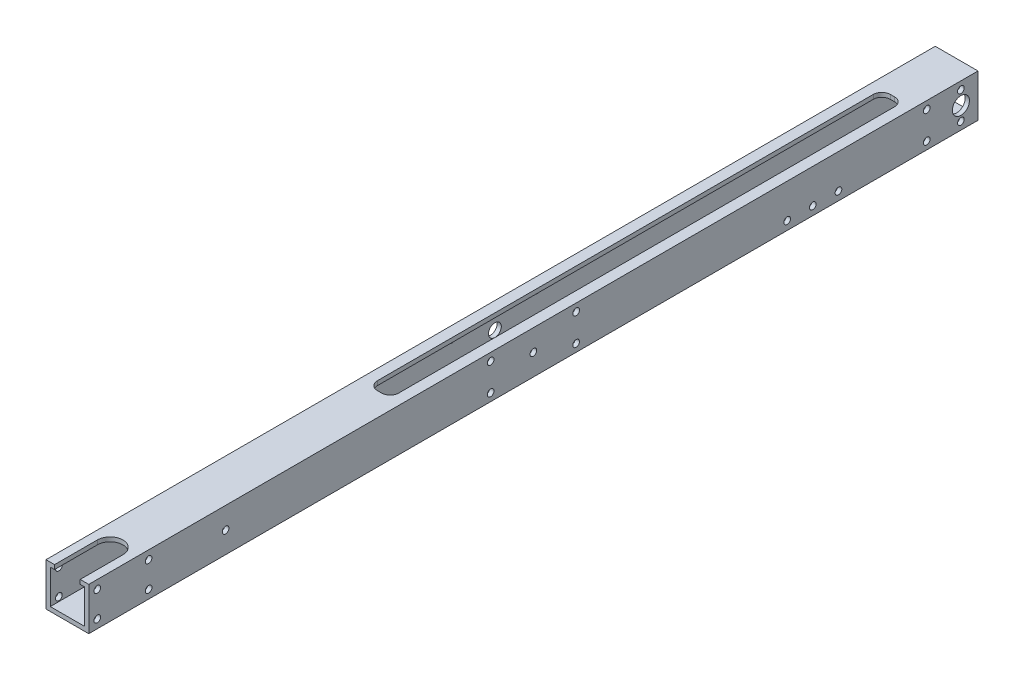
ISO-10303-21;
HEADER;
FILE_DESCRIPTION(('STEP AP214'),'2;1');
FILE_NAME('part.step','',(''),(''),'','','');
FILE_SCHEMA(('AUTOMOTIVE_DESIGN { 1 0 10303 214 1 1 1 1 }'));
ENDSEC;
DATA;
#1=APPLICATION_CONTEXT('core data for automotive mechanical design processes');
#2=APPLICATION_PROTOCOL_DEFINITION('international standard','automotive_design',2000,#1);
#3=PRODUCT_CONTEXT('',#1,'mechanical');
#4=PRODUCT('Part','Part','',(#3));
#5=PRODUCT_RELATED_PRODUCT_CATEGORY('part','',(#4));
#6=PRODUCT_DEFINITION_FORMATION('','',#4);
#7=PRODUCT_DEFINITION_CONTEXT('part definition',#1,'design');
#8=PRODUCT_DEFINITION('design','',#6,#7);
#9=PRODUCT_DEFINITION_SHAPE('','',#8);
#10=(LENGTH_UNIT() NAMED_UNIT(*) SI_UNIT(.MILLI.,.METRE.));
#11=(NAMED_UNIT(*) PLANE_ANGLE_UNIT() SI_UNIT($,.RADIAN.));
#12=(NAMED_UNIT(*) SI_UNIT($,.STERADIAN.) SOLID_ANGLE_UNIT());
#13=UNCERTAINTY_MEASURE_WITH_UNIT(LENGTH_MEASURE(1.E-05),#10,'distance_accuracy_value','');
#14=(GEOMETRIC_REPRESENTATION_CONTEXT(3) GLOBAL_UNCERTAINTY_ASSIGNED_CONTEXT((#13)) GLOBAL_UNIT_ASSIGNED_CONTEXT((#10,
#11,#12)) REPRESENTATION_CONTEXT('',''));
#15=CARTESIAN_POINT('',(0.,0.,0.));
#16=DIRECTION('',(0.,0.,1.));
#17=DIRECTION('',(1.,0.,0.));
#18=AXIS2_PLACEMENT_3D('',#15,#16,#17);
#19=CARTESIAN_POINT('',(-15.875,15.875,660.4));
#20=DIRECTION('',(0.,-1.,0.));
#21=DIRECTION('',(0.,0.,-1.));
#22=AXIS2_PLACEMENT_3D('',#19,#20,#21);
#23=PLANE('',#22);
#24=CARTESIAN_POINT('',(0.,15.875,628.65));
#25=DIRECTION('',(0.,1.,0.));
#26=DIRECTION('',(0.,0.,-1.));
#27=AXIS2_PLACEMENT_3D('',#24,#25,#26);
#28=CIRCLE('',#27,9.525);
#29=CARTESIAN_POINT('',(9.525,15.875,628.65));
#30=VERTEX_POINT('',#29);
#31=CARTESIAN_POINT('',(-9.525,15.875,628.65));
#32=VERTEX_POINT('',#31);
#33=EDGE_CURVE('E207',#30,#32,#28,.T.);
#34=ORIENTED_EDGE('',*,*,#33,.F.);
#35=DIRECTION('',(0.,0.,-1.));
#36=VECTOR('',#35,1.);
#37=CARTESIAN_POINT('',(9.525,15.875,660.4));
#38=LINE('',#37,#36);
#39=CARTESIAN_POINT('',(9.525,15.875,660.4));
#40=VERTEX_POINT('',#39);
#41=EDGE_CURVE('E188',#40,#30,#38,.T.);
#42=ORIENTED_EDGE('',*,*,#41,.F.);
#43=DIRECTION('',(-1.,0.,0.));
#44=VECTOR('',#43,1.);
#45=CARTESIAN_POINT('',(-15.875,15.875,660.4));
#46=LINE('',#45,#44);
#47=CARTESIAN_POINT('',(15.875,15.875,660.4));
#48=VERTEX_POINT('',#47);
#49=EDGE_CURVE('E385',#48,#40,#46,.T.);
#50=ORIENTED_EDGE('',*,*,#49,.F.);
#51=DIRECTION('',(0.,0.,-1.));
#52=VECTOR('',#51,1.);
#53=CARTESIAN_POINT('',(15.875,15.875,660.4));
#54=LINE('',#53,#52);
#55=CARTESIAN_POINT('',(15.875,15.875,0.));
#56=VERTEX_POINT('',#55);
#57=EDGE_CURVE('E398',#48,#56,#54,.T.);
#58=ORIENTED_EDGE('',*,*,#57,.T.);
#59=DIRECTION('',(-1.,0.,0.));
#60=VECTOR('',#59,1.);
#61=CARTESIAN_POINT('',(-15.875,15.875,0.));
#62=LINE('',#61,#60);
#63=CARTESIAN_POINT('',(-15.875,15.875,0.));
#64=VERTEX_POINT('',#63);
#65=EDGE_CURVE('E380',#56,#64,#62,.T.);
#66=ORIENTED_EDGE('',*,*,#65,.T.);
#67=DIRECTION('',(0.,0.,-1.));
#68=VECTOR('',#67,1.);
#69=CARTESIAN_POINT('',(-15.875,15.875,660.4));
#70=LINE('',#69,#68);
#71=CARTESIAN_POINT('',(-15.875,15.875,660.4));
#72=VERTEX_POINT('',#71);
#73=EDGE_CURVE('E388',#72,#64,#70,.T.);
#74=ORIENTED_EDGE('',*,*,#73,.F.);
#75=CARTESIAN_POINT('',(-9.525,15.875,660.4));
#76=VERTEX_POINT('',#75);
#77=EDGE_CURVE('E384',#76,#72,#46,.T.);
#78=ORIENTED_EDGE('',*,*,#77,.F.);
#79=DIRECTION('',(0.,0.,1.));
#80=VECTOR('',#79,1.);
#81=CARTESIAN_POINT('',(-9.525,15.875,660.4));
#82=LINE('',#81,#80);
#83=EDGE_CURVE('E204',#32,#76,#82,.T.);
#84=ORIENTED_EDGE('',*,*,#83,.F.);
#85=EDGE_LOOP('',(#34,#42,#50,#58,#66,#74,#78,#84));
#86=FACE_BOUND('',#85,.T.);
#87=DIRECTION('',(1.,0.,0.));
#88=VECTOR('',#87,1.);
#89=CARTESIAN_POINT('',(0.,15.875,47.625));
#90=LINE('',#89,#88);
#91=CARTESIAN_POINT('',(-1.5875,15.875,47.625));
#92=VERTEX_POINT('',#91);
#93=CARTESIAN_POINT('',(1.5875,15.875,47.625));
#94=VERTEX_POINT('',#93);
#95=EDGE_CURVE('E491',#92,#94,#90,.T.);
#96=ORIENTED_EDGE('',*,*,#95,.T.);
#97=CARTESIAN_POINT('',(1.5875,15.875,53.975));
#98=DIRECTION('',(0.,-1.,0.));
#99=DIRECTION('',(0.,0.,-1.));
#100=AXIS2_PLACEMENT_3D('',#97,#98,#99);
#101=CIRCLE('',#100,6.35);
#102=CARTESIAN_POINT('',(7.9375,15.875,53.975));
#103=VERTEX_POINT('',#102);
#104=EDGE_CURVE('E42',#94,#103,#101,.T.);
#105=ORIENTED_EDGE('',*,*,#104,.T.);
#106=DIRECTION('',(0.,0.,1.));
#107=VECTOR('',#106,1.);
#108=CARTESIAN_POINT('',(7.93749999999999,15.875,0.));
#109=LINE('',#108,#107);
#110=CARTESIAN_POINT('',(7.93750000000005,15.875,422.275));
#111=VERTEX_POINT('',#110);
#112=EDGE_CURVE('E490',#103,#111,#109,.T.);
#113=ORIENTED_EDGE('',*,*,#112,.T.);
#114=CARTESIAN_POINT('',(1.58750000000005,15.875,422.275));
#115=DIRECTION('',(0.,-1.,0.));
#116=DIRECTION('',(0.,0.,-1.));
#117=AXIS2_PLACEMENT_3D('',#114,#115,#116);
#118=CIRCLE('',#117,6.35);
#119=CARTESIAN_POINT('',(1.58750000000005,15.875,428.625));
#120=VERTEX_POINT('',#119);
#121=EDGE_CURVE('E475',#111,#120,#118,.T.);
#122=ORIENTED_EDGE('',*,*,#121,.T.);
#123=DIRECTION('',(1.,0.,0.));
#124=VECTOR('',#123,1.);
#125=CARTESIAN_POINT('',(0.,15.875,428.625));
#126=LINE('',#125,#124);
#127=CARTESIAN_POINT('',(-1.58750000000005,15.875,428.625));
#128=VERTEX_POINT('',#127);
#129=EDGE_CURVE('E509',#128,#120,#126,.T.);
#130=ORIENTED_EDGE('',*,*,#129,.F.);
#131=CARTESIAN_POINT('',(-1.58750000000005,15.875,422.275));
#132=DIRECTION('',(0.,-1.,0.));
#133=DIRECTION('',(0.,0.,-1.));
#134=AXIS2_PLACEMENT_3D('',#131,#132,#133);
#135=CIRCLE('',#134,6.35);
#136=CARTESIAN_POINT('',(-7.93750000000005,15.875,422.275));
#137=VERTEX_POINT('',#136);
#138=EDGE_CURVE('E479',#128,#137,#135,.T.);
#139=ORIENTED_EDGE('',*,*,#138,.T.);
#140=DIRECTION('',(0.,0.,1.));
#141=VECTOR('',#140,1.);
#142=CARTESIAN_POINT('',(-7.93749999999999,15.875,0.));
#143=LINE('',#142,#141);
#144=CARTESIAN_POINT('',(-7.9375,15.875,53.975));
#145=VERTEX_POINT('',#144);
#146=EDGE_CURVE('E516',#145,#137,#143,.T.);
#147=ORIENTED_EDGE('',*,*,#146,.F.);
#148=CARTESIAN_POINT('',(-1.5875,15.875,53.975));
#149=DIRECTION('',(0.,-1.,0.));
#150=DIRECTION('',(0.,0.,-1.));
#151=AXIS2_PLACEMENT_3D('',#148,#149,#150);
#152=CIRCLE('',#151,6.35);
#153=EDGE_CURVE('E483',#145,#92,#152,.T.);
#154=ORIENTED_EDGE('',*,*,#153,.T.);
#155=EDGE_LOOP('',(#96,#105,#113,#122,#130,#139,#147,#154));
#156=FACE_BOUND('',#155,.T.);
#157=ADVANCED_FACE('F34',(#86,#156),#23,.F.);
#158=CARTESIAN_POINT('',(-12.7,12.7,660.4));
#159=DIRECTION('',(0.,-1.,0.));
#160=DIRECTION('',(0.,0.,-1.));
#161=AXIS2_PLACEMENT_3D('',#158,#159,#160);
#162=PLANE('',#161);
#163=DIRECTION('',(0.,0.,-1.));
#164=VECTOR('',#163,1.);
#165=CARTESIAN_POINT('',(9.525,12.7,660.4));
#166=LINE('',#165,#164);
#167=CARTESIAN_POINT('',(9.525,12.7,660.4));
#168=VERTEX_POINT('',#167);
#169=CARTESIAN_POINT('',(9.525,12.7,628.65));
#170=VERTEX_POINT('',#169);
#171=EDGE_CURVE('E182',#168,#170,#166,.T.);
#172=ORIENTED_EDGE('',*,*,#171,.T.);
#173=CARTESIAN_POINT('',(0.,12.7,628.65));
#174=DIRECTION('',(0.,-1.,0.));
#175=DIRECTION('',(0.,0.,-1.));
#176=AXIS2_PLACEMENT_3D('',#173,#174,#175);
#177=CIRCLE('',#176,9.525);
#178=CARTESIAN_POINT('',(-9.525,12.7,628.65));
#179=VERTEX_POINT('',#178);
#180=EDGE_CURVE('E171',#170,#179,#177,.F.);
#181=ORIENTED_EDGE('',*,*,#180,.T.);
#182=DIRECTION('',(0.,0.,1.));
#183=VECTOR('',#182,1.);
#184=CARTESIAN_POINT('',(-9.525,12.7,660.4));
#185=LINE('',#184,#183);
#186=CARTESIAN_POINT('',(-9.525,12.7,660.4));
#187=VERTEX_POINT('',#186);
#188=EDGE_CURVE('E181',#179,#187,#185,.T.);
#189=ORIENTED_EDGE('',*,*,#188,.T.);
#190=DIRECTION('',(-1.,0.,0.));
#191=VECTOR('',#190,1.);
#192=CARTESIAN_POINT('',(-12.7,12.7,660.4));
#193=LINE('',#192,#191);
#194=CARTESIAN_POINT('',(-12.7,12.7,660.4));
#195=VERTEX_POINT('',#194);
#196=EDGE_CURVE('E353',#187,#195,#193,.T.);
#197=ORIENTED_EDGE('',*,*,#196,.T.);
#198=DIRECTION('',(0.,0.,-1.));
#199=VECTOR('',#198,1.);
#200=CARTESIAN_POINT('',(-12.7,12.7,660.4));
#201=LINE('',#200,#199);
#202=CARTESIAN_POINT('',(-12.7,12.7,0.));
#203=VERTEX_POINT('',#202);
#204=EDGE_CURVE('E355',#195,#203,#201,.T.);
#205=ORIENTED_EDGE('',*,*,#204,.T.);
#206=DIRECTION('',(-1.,0.,0.));
#207=VECTOR('',#206,1.);
#208=CARTESIAN_POINT('',(-12.7,12.7,0.));
#209=LINE('',#208,#207);
#210=CARTESIAN_POINT('',(12.7,12.7,0.));
#211=VERTEX_POINT('',#210);
#212=EDGE_CURVE('E348',#211,#203,#209,.T.);
#213=ORIENTED_EDGE('',*,*,#212,.F.);
#214=DIRECTION('',(0.,0.,-1.));
#215=VECTOR('',#214,1.);
#216=CARTESIAN_POINT('',(12.7,12.7,660.4));
#217=LINE('',#216,#215);
#218=CARTESIAN_POINT('',(12.7,12.7,660.4));
#219=VERTEX_POINT('',#218);
#220=EDGE_CURVE('E368',#219,#211,#217,.T.);
#221=ORIENTED_EDGE('',*,*,#220,.F.);
#222=EDGE_CURVE('E195',#219,#168,#193,.T.);
#223=ORIENTED_EDGE('',*,*,#222,.T.);
#224=EDGE_LOOP('',(#172,#181,#189,#197,#205,#213,#221,#223));
#225=FACE_BOUND('',#224,.T.);
#226=DIRECTION('',(0.,0.,1.));
#227=VECTOR('',#226,1.);
#228=CARTESIAN_POINT('',(-7.93749999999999,12.7,0.));
#229=LINE('',#228,#227);
#230=CARTESIAN_POINT('',(-7.9375,12.7,53.975));
#231=VERTEX_POINT('',#230);
#232=CARTESIAN_POINT('',(-7.93750000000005,12.7,422.275));
#233=VERTEX_POINT('',#232);
#234=EDGE_CURVE('E503',#231,#233,#229,.T.);
#235=ORIENTED_EDGE('',*,*,#234,.T.);
#236=CARTESIAN_POINT('',(-1.58750000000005,12.7,422.275));
#237=DIRECTION('',(0.,-1.,0.));
#238=DIRECTION('',(0.,0.,-1.));
#239=AXIS2_PLACEMENT_3D('',#236,#237,#238);
#240=CIRCLE('',#239,6.35);
#241=CARTESIAN_POINT('',(-1.58750000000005,12.7,428.625));
#242=VERTEX_POINT('',#241);
#243=EDGE_CURVE('E481',#233,#242,#240,.F.);
#244=ORIENTED_EDGE('',*,*,#243,.T.);
#245=DIRECTION('',(1.,0.,0.));
#246=VECTOR('',#245,1.);
#247=CARTESIAN_POINT('',(0.,12.7,428.625));
#248=LINE('',#247,#246);
#249=CARTESIAN_POINT('',(1.58750000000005,12.7,428.625));
#250=VERTEX_POINT('',#249);
#251=EDGE_CURVE('E507',#242,#250,#248,.T.);
#252=ORIENTED_EDGE('',*,*,#251,.T.);
#253=CARTESIAN_POINT('',(1.58750000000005,12.7,422.275));
#254=DIRECTION('',(0.,-1.,0.));
#255=DIRECTION('',(0.,0.,-1.));
#256=AXIS2_PLACEMENT_3D('',#253,#254,#255);
#257=CIRCLE('',#256,6.35);
#258=CARTESIAN_POINT('',(7.93750000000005,12.7,422.275));
#259=VERTEX_POINT('',#258);
#260=EDGE_CURVE('E477',#250,#259,#257,.F.);
#261=ORIENTED_EDGE('',*,*,#260,.T.);
#262=DIRECTION('',(0.,0.,1.));
#263=VECTOR('',#262,1.);
#264=CARTESIAN_POINT('',(7.93749999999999,12.7,0.));
#265=LINE('',#264,#263);
#266=CARTESIAN_POINT('',(7.9375,12.7,53.975));
#267=VERTEX_POINT('',#266);
#268=EDGE_CURVE('E504',#267,#259,#265,.T.);
#269=ORIENTED_EDGE('',*,*,#268,.F.);
#270=CARTESIAN_POINT('',(1.5875,12.7,53.975));
#271=DIRECTION('',(0.,-1.,0.));
#272=DIRECTION('',(0.,0.,-1.));
#273=AXIS2_PLACEMENT_3D('',#270,#271,#272);
#274=CIRCLE('',#273,6.35);
#275=CARTESIAN_POINT('',(1.5875,12.7,47.625));
#276=VERTEX_POINT('',#275);
#277=EDGE_CURVE('E11',#267,#276,#274,.F.);
#278=ORIENTED_EDGE('',*,*,#277,.T.);
#279=DIRECTION('',(1.,0.,0.));
#280=VECTOR('',#279,1.);
#281=CARTESIAN_POINT('',(0.,12.7,47.625));
#282=LINE('',#281,#280);
#283=CARTESIAN_POINT('',(-1.5875,12.7,47.625));
#284=VERTEX_POINT('',#283);
#285=EDGE_CURVE('E501',#284,#276,#282,.T.);
#286=ORIENTED_EDGE('',*,*,#285,.F.);
#287=CARTESIAN_POINT('',(-1.5875,12.7,53.975));
#288=DIRECTION('',(0.,-1.,0.));
#289=DIRECTION('',(0.,0.,-1.));
#290=AXIS2_PLACEMENT_3D('',#287,#288,#289);
#291=CIRCLE('',#290,6.35);
#292=EDGE_CURVE('E485',#284,#231,#291,.F.);
#293=ORIENTED_EDGE('',*,*,#292,.T.);
#294=EDGE_LOOP('',(#235,#244,#252,#261,#269,#278,#286,#293));
#295=FACE_BOUND('',#294,.T.);
#296=ADVANCED_FACE('F193',(#225,#295),#162,.T.);
#297=CARTESIAN_POINT('',(0.,0.,660.4));
#298=DIRECTION('',(0.,0.,-1.));
#299=DIRECTION('',(-1.,0.,0.));
#300=AXIS2_PLACEMENT_3D('',#297,#298,#299);
#301=PLANE('',#300);
#302=ORIENTED_EDGE('',*,*,#49,.T.);
#303=DIRECTION('',(0.,1.,0.));
#304=VECTOR('',#303,1.);
#305=CARTESIAN_POINT('',(9.525,-15.876,660.4));
#306=LINE('',#305,#304);
#307=EDGE_CURVE('E190',#168,#40,#306,.T.);
#308=ORIENTED_EDGE('',*,*,#307,.F.);
#309=ORIENTED_EDGE('',*,*,#222,.F.);
#310=DIRECTION('',(0.,1.,0.));
#311=VECTOR('',#310,1.);
#312=CARTESIAN_POINT('',(12.7,-12.7,660.4));
#313=LINE('',#312,#311);
#314=CARTESIAN_POINT('',(12.7,-12.7,660.4));
#315=VERTEX_POINT('',#314);
#316=EDGE_CURVE('E350',#315,#219,#313,.T.);
#317=ORIENTED_EDGE('',*,*,#316,.F.);
#318=DIRECTION('',(1.,0.,0.));
#319=VECTOR('',#318,1.);
#320=CARTESIAN_POINT('',(-12.7,-12.7,660.4));
#321=LINE('',#320,#319);
#322=CARTESIAN_POINT('',(-12.7,-12.7,660.4));
#323=VERTEX_POINT('',#322);
#324=EDGE_CURVE('E347',#323,#315,#321,.T.);
#325=ORIENTED_EDGE('',*,*,#324,.F.);
#326=DIRECTION('',(0.,-1.,0.));
#327=VECTOR('',#326,1.);
#328=CARTESIAN_POINT('',(-12.7,-12.7,660.4));
#329=LINE('',#328,#327);
#330=EDGE_CURVE('E345',#195,#323,#329,.T.);
#331=ORIENTED_EDGE('',*,*,#330,.F.);
#332=ORIENTED_EDGE('',*,*,#196,.F.);
#333=DIRECTION('',(0.,1.,0.));
#334=VECTOR('',#333,1.);
#335=CARTESIAN_POINT('',(-9.525,-15.876,660.4));
#336=LINE('',#335,#334);
#337=EDGE_CURVE('E209',#187,#76,#336,.T.);
#338=ORIENTED_EDGE('',*,*,#337,.T.);
#339=ORIENTED_EDGE('',*,*,#77,.T.);
#340=DIRECTION('',(0.,-1.,0.));
#341=VECTOR('',#340,1.);
#342=CARTESIAN_POINT('',(-15.875,-15.875,660.4));
#343=LINE('',#342,#341);
#344=CARTESIAN_POINT('',(-15.875,-15.875,660.4));
#345=VERTEX_POINT('',#344);
#346=EDGE_CURVE('E376',#72,#345,#343,.T.);
#347=ORIENTED_EDGE('',*,*,#346,.T.);
#348=DIRECTION('',(1.,0.,0.));
#349=VECTOR('',#348,1.);
#350=CARTESIAN_POINT('',(-15.875,-15.875,660.4));
#351=LINE('',#350,#349);
#352=CARTESIAN_POINT('',(15.875,-15.875,660.4));
#353=VERTEX_POINT('',#352);
#354=EDGE_CURVE('E379',#345,#353,#351,.T.);
#355=ORIENTED_EDGE('',*,*,#354,.T.);
#356=DIRECTION('',(0.,1.,0.));
#357=VECTOR('',#356,1.);
#358=CARTESIAN_POINT('',(15.875,-15.875,660.4));
#359=LINE('',#358,#357);
#360=EDGE_CURVE('E382',#353,#48,#359,.T.);
#361=ORIENTED_EDGE('',*,*,#360,.T.);
#362=EDGE_LOOP('',(#302,#308,#309,#317,#325,#331,#332,#338,#339,#347,#355,#361));
#363=FACE_BOUND('',#362,.T.);
#364=ADVANCED_FACE('F600',(#363),#301,.F.);
#365=CARTESIAN_POINT('',(0.,0.,0.));
#366=DIRECTION('',(0.,0.,-1.));
#367=DIRECTION('',(-1.,0.,0.));
#368=AXIS2_PLACEMENT_3D('',#365,#366,#367);
#369=PLANE('',#368);
#370=DIRECTION('',(0.,-1.,0.));
#371=VECTOR('',#370,1.);
#372=CARTESIAN_POINT('',(-15.875,-15.875,0.));
#373=LINE('',#372,#371);
#374=CARTESIAN_POINT('',(-15.875,-15.875,0.));
#375=VERTEX_POINT('',#374);
#376=EDGE_CURVE('E375',#64,#375,#373,.T.);
#377=ORIENTED_EDGE('',*,*,#376,.F.);
#378=ORIENTED_EDGE('',*,*,#65,.F.);
#379=DIRECTION('',(0.,1.,0.));
#380=VECTOR('',#379,1.);
#381=CARTESIAN_POINT('',(15.875,-15.875,0.));
#382=LINE('',#381,#380);
#383=CARTESIAN_POINT('',(15.875,-15.875,0.));
#384=VERTEX_POINT('',#383);
#385=EDGE_CURVE('E393',#384,#56,#382,.T.);
#386=ORIENTED_EDGE('',*,*,#385,.F.);
#387=DIRECTION('',(1.,0.,0.));
#388=VECTOR('',#387,1.);
#389=CARTESIAN_POINT('',(-15.875,-15.875,0.));
#390=LINE('',#389,#388);
#391=EDGE_CURVE('E391',#375,#384,#390,.T.);
#392=ORIENTED_EDGE('',*,*,#391,.F.);
#393=EDGE_LOOP('',(#377,#378,#386,#392));
#394=FACE_BOUND('',#393,.T.);
#395=ORIENTED_EDGE('',*,*,#212,.T.);
#396=DIRECTION('',(0.,-1.,0.));
#397=VECTOR('',#396,1.);
#398=CARTESIAN_POINT('',(-12.7,-12.7,0.));
#399=LINE('',#398,#397);
#400=CARTESIAN_POINT('',(-12.7,-12.7,0.));
#401=VERTEX_POINT('',#400);
#402=EDGE_CURVE('E344',#203,#401,#399,.T.);
#403=ORIENTED_EDGE('',*,*,#402,.T.);
#404=DIRECTION('',(1.,0.,0.));
#405=VECTOR('',#404,1.);
#406=CARTESIAN_POINT('',(-12.7,-12.7,0.));
#407=LINE('',#406,#405);
#408=CARTESIAN_POINT('',(12.7,-12.7,0.));
#409=VERTEX_POINT('',#408);
#410=EDGE_CURVE('E358',#401,#409,#407,.T.);
#411=ORIENTED_EDGE('',*,*,#410,.T.);
#412=DIRECTION('',(0.,1.,0.));
#413=VECTOR('',#412,1.);
#414=CARTESIAN_POINT('',(12.7,-12.7,0.));
#415=LINE('',#414,#413);
#416=EDGE_CURVE('E361',#409,#211,#415,.T.);
#417=ORIENTED_EDGE('',*,*,#416,.T.);
#418=EDGE_LOOP('',(#395,#403,#411,#417));
#419=FACE_BOUND('',#418,.T.);
#420=ADVANCED_FACE('F559',(#394,#419),#369,.T.);
#421=CARTESIAN_POINT('',(-15.875,-15.875,660.4));
#422=DIRECTION('',(1.,0.,0.));
#423=DIRECTION('',(0.,1.,0.));
#424=AXIS2_PLACEMENT_3D('',#421,#422,#423);
#425=PLANE('',#424);
#426=CARTESIAN_POINT('',(-15.875,-9.52500000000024,615.95));
#427=DIRECTION('',(1.,0.,0.));
#428=DIRECTION('',(0.,1.,0.));
#429=AXIS2_PLACEMENT_3D('',#426,#427,#428);
#430=CIRCLE('',#429,2.48919999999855);
#431=CARTESIAN_POINT('',(-15.875,-7.03580000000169,615.95));
#432=VERTEX_POINT('',#431);
#433=EDGE_CURVE('E456',#432,#432,#430,.T.);
#434=ORIENTED_EDGE('',*,*,#433,.T.);
#435=EDGE_LOOP('',(#434));
#436=FACE_BOUND('',#435,.T.);
#437=CARTESIAN_POINT('',(-15.875,9.52499999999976,615.95));
#438=DIRECTION('',(1.,0.,0.));
#439=DIRECTION('',(0.,1.,0.));
#440=AXIS2_PLACEMENT_3D('',#437,#438,#439);
#441=CIRCLE('',#440,2.48919999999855);
#442=CARTESIAN_POINT('',(-15.875,12.0141999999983,615.95));
#443=VERTEX_POINT('',#442);
#444=EDGE_CURVE('E451',#443,#443,#441,.T.);
#445=ORIENTED_EDGE('',*,*,#444,.T.);
#446=EDGE_LOOP('',(#445));
#447=FACE_BOUND('',#446,.T.);
#448=CARTESIAN_POINT('',(-15.875,-9.52500000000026,654.05));
#449=DIRECTION('',(1.,0.,0.));
#450=DIRECTION('',(0.,1.,0.));
#451=AXIS2_PLACEMENT_3D('',#448,#449,#450);
#452=CIRCLE('',#451,2.48919999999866);
#453=CARTESIAN_POINT('',(-15.875,-7.0358000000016,654.05));
#454=VERTEX_POINT('',#453);
#455=EDGE_CURVE('E446',#454,#454,#452,.T.);
#456=ORIENTED_EDGE('',*,*,#455,.T.);
#457=EDGE_LOOP('',(#456));
#458=FACE_BOUND('',#457,.T.);
#459=CARTESIAN_POINT('',(-15.875,9.52499999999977,654.05));
#460=DIRECTION('',(1.,0.,0.));
#461=DIRECTION('',(0.,1.,0.));
#462=AXIS2_PLACEMENT_3D('',#459,#460,#461);
#463=CIRCLE('',#462,2.48919999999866);
#464=CARTESIAN_POINT('',(-15.875,12.0141999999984,654.05));
#465=VERTEX_POINT('',#464);
#466=EDGE_CURVE('E441',#465,#465,#463,.T.);
#467=ORIENTED_EDGE('',*,*,#466,.T.);
#468=EDGE_LOOP('',(#467));
#469=FACE_BOUND('',#468,.T.);
#470=CARTESIAN_POINT('',(-15.875,8.51708460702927E-09,558.774599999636));
#471=DIRECTION('',(-1.,0.,0.));
#472=DIRECTION('',(0.,-1.,0.));
#473=AXIS2_PLACEMENT_3D('',#470,#471,#472);
#474=CIRCLE('',#473,2.48919999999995);
#475=CARTESIAN_POINT('',(-15.875,-2.48919999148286,558.774599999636));
#476=VERTEX_POINT('',#475);
#477=EDGE_CURVE('E548',#476,#476,#474,.T.);
#478=ORIENTED_EDGE('',*,*,#477,.F.);
#479=EDGE_LOOP('',(#478));
#480=FACE_BOUND('',#479,.T.);
#481=CARTESIAN_POINT('',(-15.875,0.,330.2));
#482=DIRECTION('',(-1.,0.,0.));
#483=DIRECTION('',(0.,-1.,0.));
#484=AXIS2_PLACEMENT_3D('',#481,#482,#483);
#485=CIRCLE('',#484,4.76250000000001);
#486=CARTESIAN_POINT('',(-15.875,-4.76250000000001,330.2));
#487=VERTEX_POINT('',#486);
#488=EDGE_CURVE('E218',#487,#487,#485,.T.);
#489=ORIENTED_EDGE('',*,*,#488,.F.);
#490=EDGE_LOOP('',(#489));
#491=FACE_BOUND('',#490,.T.);
#492=CARTESIAN_POINT('',(-15.875,-9.52500000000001,141.732));
#493=DIRECTION('',(1.,0.,0.));
#494=DIRECTION('',(0.,1.,0.));
#495=AXIS2_PLACEMENT_3D('',#492,#493,#494);
#496=CIRCLE('',#495,2.4892);
#497=CARTESIAN_POINT('',(-15.875,-7.03580000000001,141.732));
#498=VERTEX_POINT('',#497);
#499=EDGE_CURVE('E224',#498,#498,#496,.T.);
#500=ORIENTED_EDGE('',*,*,#499,.T.);
#501=EDGE_LOOP('',(#500));
#502=FACE_BOUND('',#501,.T.);
#503=CARTESIAN_POINT('',(-15.875,-9.52500000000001,122.682));
#504=DIRECTION('',(1.,0.,0.));
#505=DIRECTION('',(0.,1.,0.));
#506=AXIS2_PLACEMENT_3D('',#503,#504,#505);
#507=CIRCLE('',#506,2.4892);
#508=CARTESIAN_POINT('',(-15.875,-7.03580000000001,122.682));
#509=VERTEX_POINT('',#508);
#510=EDGE_CURVE('E235',#509,#509,#507,.T.);
#511=ORIENTED_EDGE('',*,*,#510,.T.);
#512=EDGE_LOOP('',(#511));
#513=FACE_BOUND('',#512,.T.);
#514=CARTESIAN_POINT('',(-15.875,-10.16,12.7));
#515=DIRECTION('',(1.,0.,0.));
#516=DIRECTION('',(0.,1.,0.));
#517=AXIS2_PLACEMENT_3D('',#514,#515,#516);
#518=CIRCLE('',#517,2.4892);
#519=CARTESIAN_POINT('',(-15.875,-7.6708,12.7));
#520=VERTEX_POINT('',#519);
#521=EDGE_CURVE('E245',#520,#520,#518,.T.);
#522=ORIENTED_EDGE('',*,*,#521,.T.);
#523=EDGE_LOOP('',(#522));
#524=FACE_BOUND('',#523,.T.);
#525=CARTESIAN_POINT('',(-15.875,10.16,12.7));
#526=DIRECTION('',(1.,0.,0.));
#527=DIRECTION('',(0.,1.,0.));
#528=AXIS2_PLACEMENT_3D('',#525,#526,#527);
#529=CIRCLE('',#528,2.4892);
#530=CARTESIAN_POINT('',(-15.875,12.6492,12.7));
#531=VERTEX_POINT('',#530);
#532=EDGE_CURVE('E255',#531,#531,#529,.T.);
#533=ORIENTED_EDGE('',*,*,#532,.T.);
#534=EDGE_LOOP('',(#533));
#535=FACE_BOUND('',#534,.T.);
#536=CARTESIAN_POINT('',(-15.875,-9.52500000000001,103.632));
#537=DIRECTION('',(1.,0.,0.));
#538=DIRECTION('',(0.,1.,0.));
#539=AXIS2_PLACEMENT_3D('',#536,#537,#538);
#540=CIRCLE('',#539,2.48920000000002);
#541=CARTESIAN_POINT('',(-15.875,-7.03579999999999,103.632));
#542=VERTEX_POINT('',#541);
#543=EDGE_CURVE('E265',#542,#542,#540,.T.);
#544=ORIENTED_EDGE('',*,*,#543,.T.);
#545=EDGE_LOOP('',(#544));
#546=FACE_BOUND('',#545,.T.);
#547=CARTESIAN_POINT('',(-15.875,-10.16,38.1));
#548=DIRECTION('',(1.,0.,0.));
#549=DIRECTION('',(0.,1.,0.));
#550=AXIS2_PLACEMENT_3D('',#547,#548,#549);
#551=CIRCLE('',#550,2.4892);
#552=CARTESIAN_POINT('',(-15.875,-7.6708,38.1));
#553=VERTEX_POINT('',#552);
#554=EDGE_CURVE('E275',#553,#553,#551,.T.);
#555=ORIENTED_EDGE('',*,*,#554,.T.);
#556=EDGE_LOOP('',(#555));
#557=FACE_BOUND('',#556,.T.);
#558=CARTESIAN_POINT('',(-15.875,10.16,38.1));
#559=DIRECTION('',(1.,0.,0.));
#560=DIRECTION('',(0.,1.,0.));
#561=AXIS2_PLACEMENT_3D('',#558,#559,#560);
#562=CIRCLE('',#561,2.4892);
#563=CARTESIAN_POINT('',(-15.875,12.6492,38.1));
#564=VERTEX_POINT('',#563);
#565=EDGE_CURVE('E285',#564,#564,#562,.T.);
#566=ORIENTED_EDGE('',*,*,#565,.T.);
#567=EDGE_LOOP('',(#566));
#568=FACE_BOUND('',#567,.T.);
#569=CARTESIAN_POINT('',(-15.875,-10.16,361.95));
#570=DIRECTION('',(1.,0.,0.));
#571=DIRECTION('',(0.,1.,0.));
#572=AXIS2_PLACEMENT_3D('',#569,#570,#571);
#573=CIRCLE('',#572,2.48920000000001);
#574=CARTESIAN_POINT('',(-15.875,-7.67080000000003,361.95));
#575=VERTEX_POINT('',#574);
#576=EDGE_CURVE('E295',#575,#575,#573,.T.);
#577=ORIENTED_EDGE('',*,*,#576,.T.);
#578=EDGE_LOOP('',(#577));
#579=FACE_BOUND('',#578,.T.);
#580=CARTESIAN_POINT('',(-15.875,-10.16,298.45));
#581=DIRECTION('',(1.,0.,0.));
#582=DIRECTION('',(0.,1.,0.));
#583=AXIS2_PLACEMENT_3D('',#580,#581,#582);
#584=CIRCLE('',#583,2.48920000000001);
#585=CARTESIAN_POINT('',(-15.875,-7.67080000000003,298.45));
#586=VERTEX_POINT('',#585);
#587=EDGE_CURVE('E305',#586,#586,#584,.T.);
#588=ORIENTED_EDGE('',*,*,#587,.T.);
#589=EDGE_LOOP('',(#588));
#590=FACE_BOUND('',#589,.T.);
#591=CARTESIAN_POINT('',(-15.875,10.16,298.45));
#592=DIRECTION('',(1.,0.,0.));
#593=DIRECTION('',(0.,1.,0.));
#594=AXIS2_PLACEMENT_3D('',#591,#592,#593);
#595=CIRCLE('',#594,2.48920000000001);
#596=CARTESIAN_POINT('',(-15.875,12.6492,298.45));
#597=VERTEX_POINT('',#596);
#598=EDGE_CURVE('E315',#597,#597,#595,.T.);
#599=ORIENTED_EDGE('',*,*,#598,.T.);
#600=EDGE_LOOP('',(#599));
#601=FACE_BOUND('',#600,.T.);
#602=CARTESIAN_POINT('',(-15.875,10.16,361.95));
#603=DIRECTION('',(1.,0.,0.));
#604=DIRECTION('',(0.,1.,0.));
#605=AXIS2_PLACEMENT_3D('',#602,#603,#604);
#606=CIRCLE('',#605,2.48920000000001);
#607=CARTESIAN_POINT('',(-15.875,12.6492,361.95));
#608=VERTEX_POINT('',#607);
#609=EDGE_CURVE('E325',#608,#608,#606,.T.);
#610=ORIENTED_EDGE('',*,*,#609,.T.);
#611=EDGE_LOOP('',(#610));
#612=FACE_BOUND('',#611,.T.);
#613=CARTESIAN_POINT('',(-15.875,0.,12.7));
#614=DIRECTION('',(1.,0.,0.));
#615=DIRECTION('',(0.,1.,0.));
#616=AXIS2_PLACEMENT_3D('',#613,#614,#615);
#617=CIRCLE('',#616,2.4892);
#618=CARTESIAN_POINT('',(-15.875,2.4892,12.7));
#619=VERTEX_POINT('',#618);
#620=EDGE_CURVE('E338',#619,#619,#617,.T.);
#621=ORIENTED_EDGE('',*,*,#620,.T.);
#622=EDGE_LOOP('',(#621));
#623=FACE_BOUND('',#622,.T.);
#624=ORIENTED_EDGE('',*,*,#376,.T.);
#625=DIRECTION('',(0.,0.,-1.));
#626=VECTOR('',#625,1.);
#627=CARTESIAN_POINT('',(-15.875,-15.875,660.4));
#628=LINE('',#627,#626);
#629=EDGE_CURVE('E404',#345,#375,#628,.T.);
#630=ORIENTED_EDGE('',*,*,#629,.F.);
#631=ORIENTED_EDGE('',*,*,#346,.F.);
#632=ORIENTED_EDGE('',*,*,#73,.T.);
#633=EDGE_LOOP('',(#624,#630,#631,#632));
#634=FACE_BOUND('',#633,.T.);
#635=ADVANCED_FACE('F555',(#436,#447,#458,#469,#480,#491,#502,#513,#524,#535,#546,#557,#568,
#579,#590,#601,#612,#623,#634),#425,.F.);
#636=CARTESIAN_POINT('',(-15.875,-15.875,660.4));
#637=DIRECTION('',(0.,1.,0.));
#638=DIRECTION('',(0.,0.,1.));
#639=AXIS2_PLACEMENT_3D('',#636,#637,#638);
#640=PLANE('',#639);
#641=ORIENTED_EDGE('',*,*,#391,.T.);
#642=DIRECTION('',(0.,0.,-1.));
#643=VECTOR('',#642,1.);
#644=CARTESIAN_POINT('',(15.875,-15.875,660.4));
#645=LINE('',#644,#643);
#646=EDGE_CURVE('E401',#353,#384,#645,.T.);
#647=ORIENTED_EDGE('',*,*,#646,.F.);
#648=ORIENTED_EDGE('',*,*,#354,.F.);
#649=ORIENTED_EDGE('',*,*,#629,.T.);
#650=EDGE_LOOP('',(#641,#647,#648,#649));
#651=FACE_BOUND('',#650,.T.);
#652=ADVANCED_FACE('F558',(#651),#640,.F.);
#653=CARTESIAN_POINT('',(15.875,-15.875,660.4));
#654=DIRECTION('',(-1.,0.,0.));
#655=DIRECTION('',(0.,-1.,0.));
#656=AXIS2_PLACEMENT_3D('',#653,#654,#655);
#657=PLANE('',#656);
#658=CARTESIAN_POINT('',(15.875,-9.52500000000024,615.95));
#659=DIRECTION('',(1.,0.,0.));
#660=DIRECTION('',(0.,1.,0.));
#661=AXIS2_PLACEMENT_3D('',#658,#659,#660);
#662=CIRCLE('',#661,2.48919999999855);
#663=CARTESIAN_POINT('',(15.875,-7.03580000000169,615.95));
#664=VERTEX_POINT('',#663);
#665=EDGE_CURVE('E513',#664,#664,#662,.T.);
#666=ORIENTED_EDGE('',*,*,#665,.F.);
#667=EDGE_LOOP('',(#666));
#668=FACE_BOUND('',#667,.T.);
#669=CARTESIAN_POINT('',(15.875,9.52499999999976,615.95));
#670=DIRECTION('',(1.,0.,0.));
#671=DIRECTION('',(0.,1.,0.));
#672=AXIS2_PLACEMENT_3D('',#669,#670,#671);
#673=CIRCLE('',#672,2.48919999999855);
#674=CARTESIAN_POINT('',(15.875,12.0141999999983,615.95));
#675=VERTEX_POINT('',#674);
#676=EDGE_CURVE('E527',#675,#675,#673,.T.);
#677=ORIENTED_EDGE('',*,*,#676,.F.);
#678=EDGE_LOOP('',(#677));
#679=FACE_BOUND('',#678,.T.);
#680=CARTESIAN_POINT('',(15.875,-9.52500000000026,654.05));
#681=DIRECTION('',(1.,0.,0.));
#682=DIRECTION('',(0.,1.,0.));
#683=AXIS2_PLACEMENT_3D('',#680,#681,#682);
#684=CIRCLE('',#683,2.48919999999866);
#685=CARTESIAN_POINT('',(15.875,-7.0358000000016,654.05));
#686=VERTEX_POINT('',#685);
#687=EDGE_CURVE('E534',#686,#686,#684,.T.);
#688=ORIENTED_EDGE('',*,*,#687,.F.);
#689=EDGE_LOOP('',(#688));
#690=FACE_BOUND('',#689,.T.);
#691=CARTESIAN_POINT('',(15.875,9.52499999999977,654.05));
#692=DIRECTION('',(1.,0.,0.));
#693=DIRECTION('',(0.,1.,0.));
#694=AXIS2_PLACEMENT_3D('',#691,#692,#693);
#695=CIRCLE('',#694,2.48919999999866);
#696=CARTESIAN_POINT('',(15.875,12.0141999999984,654.05));
#697=VERTEX_POINT('',#696);
#698=EDGE_CURVE('E541',#697,#697,#695,.T.);
#699=ORIENTED_EDGE('',*,*,#698,.F.);
#700=EDGE_LOOP('',(#699));
#701=FACE_BOUND('',#700,.T.);
#702=CARTESIAN_POINT('',(15.875,8.51708113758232E-09,558.774599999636));
#703=DIRECTION('',(-1.,0.,0.));
#704=DIRECTION('',(0.,-1.,0.));
#705=AXIS2_PLACEMENT_3D('',#702,#703,#704);
#706=CIRCLE('',#705,2.48919999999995);
#707=CARTESIAN_POINT('',(15.875,-2.48919999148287,558.774599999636));
#708=VERTEX_POINT('',#707);
#709=EDGE_CURVE('E436',#708,#708,#706,.T.);
#710=ORIENTED_EDGE('',*,*,#709,.T.);
#711=EDGE_LOOP('',(#710));
#712=FACE_BOUND('',#711,.T.);
#713=CARTESIAN_POINT('',(15.875,0.,12.7));
#714=DIRECTION('',(1.,0.,0.));
#715=DIRECTION('',(0.,1.,0.));
#716=AXIS2_PLACEMENT_3D('',#713,#714,#715);
#717=CIRCLE('',#716,6.35);
#718=CARTESIAN_POINT('',(15.875,6.35,12.7));
#719=VERTEX_POINT('',#718);
#720=EDGE_CURVE('E215',#719,#719,#717,.T.);
#721=ORIENTED_EDGE('',*,*,#720,.F.);
#722=EDGE_LOOP('',(#721));
#723=FACE_BOUND('',#722,.T.);
#724=CARTESIAN_POINT('',(15.875,-9.52500000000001,141.732));
#725=DIRECTION('',(1.,0.,0.));
#726=DIRECTION('',(0.,1.,0.));
#727=AXIS2_PLACEMENT_3D('',#724,#725,#726);
#728=CIRCLE('',#727,2.4892);
#729=CARTESIAN_POINT('',(15.875,-7.0358,141.732));
#730=VERTEX_POINT('',#729);
#731=EDGE_CURVE('E228',#730,#730,#728,.T.);
#732=ORIENTED_EDGE('',*,*,#731,.F.);
#733=EDGE_LOOP('',(#732));
#734=FACE_BOUND('',#733,.T.);
#735=CARTESIAN_POINT('',(15.875,-9.52500000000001,122.682));
#736=DIRECTION('',(1.,0.,0.));
#737=DIRECTION('',(0.,1.,0.));
#738=AXIS2_PLACEMENT_3D('',#735,#736,#737);
#739=CIRCLE('',#738,2.4892);
#740=CARTESIAN_POINT('',(15.875,-7.0358,122.682));
#741=VERTEX_POINT('',#740);
#742=EDGE_CURVE('E234',#741,#741,#739,.T.);
#743=ORIENTED_EDGE('',*,*,#742,.F.);
#744=EDGE_LOOP('',(#743));
#745=FACE_BOUND('',#744,.T.);
#746=CARTESIAN_POINT('',(15.875,-10.16,12.7));
#747=DIRECTION('',(1.,0.,0.));
#748=DIRECTION('',(0.,1.,0.));
#749=AXIS2_PLACEMENT_3D('',#746,#747,#748);
#750=CIRCLE('',#749,2.4892);
#751=CARTESIAN_POINT('',(15.875,-7.67079999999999,12.7));
#752=VERTEX_POINT('',#751);
#753=EDGE_CURVE('E244',#752,#752,#750,.T.);
#754=ORIENTED_EDGE('',*,*,#753,.F.);
#755=EDGE_LOOP('',(#754));
#756=FACE_BOUND('',#755,.T.);
#757=CARTESIAN_POINT('',(15.875,10.16,12.7));
#758=DIRECTION('',(1.,0.,0.));
#759=DIRECTION('',(0.,1.,0.));
#760=AXIS2_PLACEMENT_3D('',#757,#758,#759);
#761=CIRCLE('',#760,2.4892);
#762=CARTESIAN_POINT('',(15.875,12.6492,12.7));
#763=VERTEX_POINT('',#762);
#764=EDGE_CURVE('E254',#763,#763,#761,.T.);
#765=ORIENTED_EDGE('',*,*,#764,.F.);
#766=EDGE_LOOP('',(#765));
#767=FACE_BOUND('',#766,.T.);
#768=CARTESIAN_POINT('',(15.875,-9.52500000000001,103.632));
#769=DIRECTION('',(1.,0.,0.));
#770=DIRECTION('',(0.,1.,0.));
#771=AXIS2_PLACEMENT_3D('',#768,#769,#770);
#772=CIRCLE('',#771,2.48920000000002);
#773=CARTESIAN_POINT('',(15.875,-7.03579999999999,103.632));
#774=VERTEX_POINT('',#773);
#775=EDGE_CURVE('E264',#774,#774,#772,.T.);
#776=ORIENTED_EDGE('',*,*,#775,.F.);
#777=EDGE_LOOP('',(#776));
#778=FACE_BOUND('',#777,.T.);
#779=CARTESIAN_POINT('',(15.875,-10.16,38.1));
#780=DIRECTION('',(1.,0.,0.));
#781=DIRECTION('',(0.,1.,0.));
#782=AXIS2_PLACEMENT_3D('',#779,#780,#781);
#783=CIRCLE('',#782,2.4892);
#784=CARTESIAN_POINT('',(15.875,-7.6708,38.1));
#785=VERTEX_POINT('',#784);
#786=EDGE_CURVE('E274',#785,#785,#783,.T.);
#787=ORIENTED_EDGE('',*,*,#786,.F.);
#788=EDGE_LOOP('',(#787));
#789=FACE_BOUND('',#788,.T.);
#790=CARTESIAN_POINT('',(15.875,10.16,38.1));
#791=DIRECTION('',(1.,0.,0.));
#792=DIRECTION('',(0.,1.,0.));
#793=AXIS2_PLACEMENT_3D('',#790,#791,#792);
#794=CIRCLE('',#793,2.4892);
#795=CARTESIAN_POINT('',(15.875,12.6492,38.1));
#796=VERTEX_POINT('',#795);
#797=EDGE_CURVE('E284',#796,#796,#794,.T.);
#798=ORIENTED_EDGE('',*,*,#797,.F.);
#799=EDGE_LOOP('',(#798));
#800=FACE_BOUND('',#799,.T.);
#801=CARTESIAN_POINT('',(15.875,-10.16,361.95));
#802=DIRECTION('',(1.,0.,0.));
#803=DIRECTION('',(0.,1.,0.));
#804=AXIS2_PLACEMENT_3D('',#801,#802,#803);
#805=CIRCLE('',#804,2.48920000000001);
#806=CARTESIAN_POINT('',(15.875,-7.67080000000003,361.95));
#807=VERTEX_POINT('',#806);
#808=EDGE_CURVE('E294',#807,#807,#805,.T.);
#809=ORIENTED_EDGE('',*,*,#808,.F.);
#810=EDGE_LOOP('',(#809));
#811=FACE_BOUND('',#810,.T.);
#812=CARTESIAN_POINT('',(15.875,-10.16,298.45));
#813=DIRECTION('',(1.,0.,0.));
#814=DIRECTION('',(0.,1.,0.));
#815=AXIS2_PLACEMENT_3D('',#812,#813,#814);
#816=CIRCLE('',#815,2.48920000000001);
#817=CARTESIAN_POINT('',(15.875,-7.67080000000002,298.45));
#818=VERTEX_POINT('',#817);
#819=EDGE_CURVE('E304',#818,#818,#816,.T.);
#820=ORIENTED_EDGE('',*,*,#819,.F.);
#821=EDGE_LOOP('',(#820));
#822=FACE_BOUND('',#821,.T.);
#823=CARTESIAN_POINT('',(15.875,10.16,298.45));
#824=DIRECTION('',(1.,0.,0.));
#825=DIRECTION('',(0.,1.,0.));
#826=AXIS2_PLACEMENT_3D('',#823,#824,#825);
#827=CIRCLE('',#826,2.48920000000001);
#828=CARTESIAN_POINT('',(15.875,12.6492,298.45));
#829=VERTEX_POINT('',#828);
#830=EDGE_CURVE('E314',#829,#829,#827,.T.);
#831=ORIENTED_EDGE('',*,*,#830,.F.);
#832=EDGE_LOOP('',(#831));
#833=FACE_BOUND('',#832,.T.);
#834=CARTESIAN_POINT('',(15.875,10.16,361.95));
#835=DIRECTION('',(1.,0.,0.));
#836=DIRECTION('',(0.,1.,0.));
#837=AXIS2_PLACEMENT_3D('',#834,#835,#836);
#838=CIRCLE('',#837,2.48920000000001);
#839=CARTESIAN_POINT('',(15.875,12.6492,361.95));
#840=VERTEX_POINT('',#839);
#841=EDGE_CURVE('E324',#840,#840,#838,.T.);
#842=ORIENTED_EDGE('',*,*,#841,.F.);
#843=EDGE_LOOP('',(#842));
#844=FACE_BOUND('',#843,.T.);
#845=CARTESIAN_POINT('',(15.875,0.,330.2));
#846=DIRECTION('',(1.,0.,0.));
#847=DIRECTION('',(0.,1.,0.));
#848=AXIS2_PLACEMENT_3D('',#845,#846,#847);
#849=CIRCLE('',#848,2.48920000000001);
#850=CARTESIAN_POINT('',(15.875,2.48920000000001,330.2));
#851=VERTEX_POINT('',#850);
#852=EDGE_CURVE('E334',#851,#851,#849,.T.);
#853=ORIENTED_EDGE('',*,*,#852,.F.);
#854=EDGE_LOOP('',(#853));
#855=FACE_BOUND('',#854,.T.);
#856=ORIENTED_EDGE('',*,*,#385,.T.);
#857=ORIENTED_EDGE('',*,*,#57,.F.);
#858=ORIENTED_EDGE('',*,*,#360,.F.);
#859=ORIENTED_EDGE('',*,*,#646,.T.);
#860=EDGE_LOOP('',(#856,#857,#858,#859));
#861=FACE_BOUND('',#860,.T.);
#862=ADVANCED_FACE('F608',(#668,#679,#690,#701,#712,#723,#734,#745,#756,#767,#778,#789,#800,
#811,#822,#833,#844,#855,#861),#657,.F.);
#863=CARTESIAN_POINT('',(-12.7,-12.7,660.4));
#864=DIRECTION('',(1.,0.,0.));
#865=DIRECTION('',(0.,1.,0.));
#866=AXIS2_PLACEMENT_3D('',#863,#864,#865);
#867=PLANE('',#866);
#868=CARTESIAN_POINT('',(-12.7,-9.52500000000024,615.95));
#869=DIRECTION('',(1.,0.,0.));
#870=DIRECTION('',(0.,1.,0.));
#871=AXIS2_PLACEMENT_3D('',#868,#869,#870);
#872=CIRCLE('',#871,2.48919999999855);
#873=CARTESIAN_POINT('',(-12.7,-7.03580000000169,615.95));
#874=VERTEX_POINT('',#873);
#875=EDGE_CURVE('E455',#874,#874,#872,.T.);
#876=ORIENTED_EDGE('',*,*,#875,.F.);
#877=EDGE_LOOP('',(#876));
#878=FACE_BOUND('',#877,.T.);
#879=CARTESIAN_POINT('',(-12.7,9.52499999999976,615.95));
#880=DIRECTION('',(1.,0.,0.));
#881=DIRECTION('',(0.,1.,0.));
#882=AXIS2_PLACEMENT_3D('',#879,#880,#881);
#883=CIRCLE('',#882,2.48919999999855);
#884=CARTESIAN_POINT('',(-12.7,12.0141999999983,615.95));
#885=VERTEX_POINT('',#884);
#886=EDGE_CURVE('E450',#885,#885,#883,.T.);
#887=ORIENTED_EDGE('',*,*,#886,.F.);
#888=EDGE_LOOP('',(#887));
#889=FACE_BOUND('',#888,.T.);
#890=CARTESIAN_POINT('',(-12.7,-9.52500000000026,654.05));
#891=DIRECTION('',(1.,0.,0.));
#892=DIRECTION('',(0.,1.,0.));
#893=AXIS2_PLACEMENT_3D('',#890,#891,#892);
#894=CIRCLE('',#893,2.48919999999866);
#895=CARTESIAN_POINT('',(-12.7,-7.0358000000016,654.05));
#896=VERTEX_POINT('',#895);
#897=EDGE_CURVE('E445',#896,#896,#894,.T.);
#898=ORIENTED_EDGE('',*,*,#897,.F.);
#899=EDGE_LOOP('',(#898));
#900=FACE_BOUND('',#899,.T.);
#901=CARTESIAN_POINT('',(-12.7,9.52499999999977,654.05));
#902=DIRECTION('',(1.,0.,0.));
#903=DIRECTION('',(0.,1.,0.));
#904=AXIS2_PLACEMENT_3D('',#901,#902,#903);
#905=CIRCLE('',#904,2.48919999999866);
#906=CARTESIAN_POINT('',(-12.7,12.0141999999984,654.05));
#907=VERTEX_POINT('',#906);
#908=EDGE_CURVE('E440',#907,#907,#905,.T.);
#909=ORIENTED_EDGE('',*,*,#908,.F.);
#910=EDGE_LOOP('',(#909));
#911=FACE_BOUND('',#910,.T.);
#912=CARTESIAN_POINT('',(-12.7,8.51708426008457E-09,558.774599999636));
#913=DIRECTION('',(1.,0.,0.));
#914=DIRECTION('',(0.,1.,0.));
#915=AXIS2_PLACEMENT_3D('',#912,#913,#914);
#916=CIRCLE('',#915,2.48919999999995);
#917=CARTESIAN_POINT('',(-12.7,2.48920000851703,558.774599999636));
#918=VERTEX_POINT('',#917);
#919=EDGE_CURVE('E196',#918,#918,#916,.T.);
#920=ORIENTED_EDGE('',*,*,#919,.F.);
#921=EDGE_LOOP('',(#920));
#922=FACE_BOUND('',#921,.T.);
#923=CARTESIAN_POINT('',(-12.7,0.,330.2));
#924=DIRECTION('',(1.,0.,0.));
#925=DIRECTION('',(0.,1.,0.));
#926=AXIS2_PLACEMENT_3D('',#923,#924,#925);
#927=CIRCLE('',#926,4.76250000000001);
#928=CARTESIAN_POINT('',(-12.7,4.76250000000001,330.2));
#929=VERTEX_POINT('',#928);
#930=EDGE_CURVE('E223',#929,#929,#927,.T.);
#931=ORIENTED_EDGE('',*,*,#930,.F.);
#932=EDGE_LOOP('',(#931));
#933=FACE_BOUND('',#932,.T.);
#934=CARTESIAN_POINT('',(-12.7,-9.52500000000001,141.732));
#935=DIRECTION('',(1.,0.,0.));
#936=DIRECTION('',(0.,1.,0.));
#937=AXIS2_PLACEMENT_3D('',#934,#935,#936);
#938=CIRCLE('',#937,2.4892);
#939=CARTESIAN_POINT('',(-12.7,-7.03580000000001,141.732));
#940=VERTEX_POINT('',#939);
#941=EDGE_CURVE('E231',#940,#940,#938,.T.);
#942=ORIENTED_EDGE('',*,*,#941,.F.);
#943=EDGE_LOOP('',(#942));
#944=FACE_BOUND('',#943,.T.);
#945=CARTESIAN_POINT('',(-12.7,-9.52500000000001,122.682));
#946=DIRECTION('',(1.,0.,0.));
#947=DIRECTION('',(0.,1.,0.));
#948=AXIS2_PLACEMENT_3D('',#945,#946,#947);
#949=CIRCLE('',#948,2.4892);
#950=CARTESIAN_POINT('',(-12.7,-7.03580000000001,122.682));
#951=VERTEX_POINT('',#950);
#952=EDGE_CURVE('E241',#951,#951,#949,.T.);
#953=ORIENTED_EDGE('',*,*,#952,.F.);
#954=EDGE_LOOP('',(#953));
#955=FACE_BOUND('',#954,.T.);
#956=CARTESIAN_POINT('',(-12.7,-10.16,12.7));
#957=DIRECTION('',(1.,0.,0.));
#958=DIRECTION('',(0.,1.,0.));
#959=AXIS2_PLACEMENT_3D('',#956,#957,#958);
#960=CIRCLE('',#959,2.4892);
#961=CARTESIAN_POINT('',(-12.7,-7.6708,12.7));
#962=VERTEX_POINT('',#961);
#963=EDGE_CURVE('E251',#962,#962,#960,.T.);
#964=ORIENTED_EDGE('',*,*,#963,.F.);
#965=EDGE_LOOP('',(#964));
#966=FACE_BOUND('',#965,.T.);
#967=CARTESIAN_POINT('',(-12.7,10.16,12.7));
#968=DIRECTION('',(1.,0.,0.));
#969=DIRECTION('',(0.,1.,0.));
#970=AXIS2_PLACEMENT_3D('',#967,#968,#969);
#971=CIRCLE('',#970,2.4892);
#972=CARTESIAN_POINT('',(-12.7,12.6492,12.7));
#973=VERTEX_POINT('',#972);
#974=EDGE_CURVE('E261',#973,#973,#971,.T.);
#975=ORIENTED_EDGE('',*,*,#974,.F.);
#976=EDGE_LOOP('',(#975));
#977=FACE_BOUND('',#976,.T.);
#978=CARTESIAN_POINT('',(-12.7,-9.52500000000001,103.632));
#979=DIRECTION('',(1.,0.,0.));
#980=DIRECTION('',(0.,1.,0.));
#981=AXIS2_PLACEMENT_3D('',#978,#979,#980);
#982=CIRCLE('',#981,2.48920000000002);
#983=CARTESIAN_POINT('',(-12.7,-7.03579999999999,103.632));
#984=VERTEX_POINT('',#983);
#985=EDGE_CURVE('E271',#984,#984,#982,.T.);
#986=ORIENTED_EDGE('',*,*,#985,.F.);
#987=EDGE_LOOP('',(#986));
#988=FACE_BOUND('',#987,.T.);
#989=CARTESIAN_POINT('',(-12.7,-10.16,38.1));
#990=DIRECTION('',(1.,0.,0.));
#991=DIRECTION('',(0.,1.,0.));
#992=AXIS2_PLACEMENT_3D('',#989,#990,#991);
#993=CIRCLE('',#992,2.4892);
#994=CARTESIAN_POINT('',(-12.7,-7.6708,38.1));
#995=VERTEX_POINT('',#994);
#996=EDGE_CURVE('E281',#995,#995,#993,.T.);
#997=ORIENTED_EDGE('',*,*,#996,.F.);
#998=EDGE_LOOP('',(#997));
#999=FACE_BOUND('',#998,.T.);
#1000=CARTESIAN_POINT('',(-12.7,10.16,38.1));
#1001=DIRECTION('',(1.,0.,0.));
#1002=DIRECTION('',(0.,1.,0.));
#1003=AXIS2_PLACEMENT_3D('',#1000,#1001,#1002);
#1004=CIRCLE('',#1003,2.4892);
#1005=CARTESIAN_POINT('',(-12.7,12.6492,38.1));
#1006=VERTEX_POINT('',#1005);
#1007=EDGE_CURVE('E291',#1006,#1006,#1004,.T.);
#1008=ORIENTED_EDGE('',*,*,#1007,.F.);
#1009=EDGE_LOOP('',(#1008));
#1010=FACE_BOUND('',#1009,.T.);
#1011=CARTESIAN_POINT('',(-12.7,-10.16,361.95));
#1012=DIRECTION('',(1.,0.,0.));
#1013=DIRECTION('',(0.,1.,0.));
#1014=AXIS2_PLACEMENT_3D('',#1011,#1012,#1013);
#1015=CIRCLE('',#1014,2.48920000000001);
#1016=CARTESIAN_POINT('',(-12.7,-7.67080000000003,361.95));
#1017=VERTEX_POINT('',#1016);
#1018=EDGE_CURVE('E301',#1017,#1017,#1015,.T.);
#1019=ORIENTED_EDGE('',*,*,#1018,.F.);
#1020=EDGE_LOOP('',(#1019));
#1021=FACE_BOUND('',#1020,.T.);
#1022=CARTESIAN_POINT('',(-12.7,-10.16,298.45));
#1023=DIRECTION('',(1.,0.,0.));
#1024=DIRECTION('',(0.,1.,0.));
#1025=AXIS2_PLACEMENT_3D('',#1022,#1023,#1024);
#1026=CIRCLE('',#1025,2.48920000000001);
#1027=CARTESIAN_POINT('',(-12.7,-7.67080000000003,298.45));
#1028=VERTEX_POINT('',#1027);
#1029=EDGE_CURVE('E311',#1028,#1028,#1026,.T.);
#1030=ORIENTED_EDGE('',*,*,#1029,.F.);
#1031=EDGE_LOOP('',(#1030));
#1032=FACE_BOUND('',#1031,.T.);
#1033=CARTESIAN_POINT('',(-12.7,10.16,298.45));
#1034=DIRECTION('',(1.,0.,0.));
#1035=DIRECTION('',(0.,1.,0.));
#1036=AXIS2_PLACEMENT_3D('',#1033,#1034,#1035);
#1037=CIRCLE('',#1036,2.48920000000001);
#1038=CARTESIAN_POINT('',(-12.7,12.6492,298.45));
#1039=VERTEX_POINT('',#1038);
#1040=EDGE_CURVE('E321',#1039,#1039,#1037,.T.);
#1041=ORIENTED_EDGE('',*,*,#1040,.F.);
#1042=EDGE_LOOP('',(#1041));
#1043=FACE_BOUND('',#1042,.T.);
#1044=CARTESIAN_POINT('',(-12.7,10.16,361.95));
#1045=DIRECTION('',(1.,0.,0.));
#1046=DIRECTION('',(0.,1.,0.));
#1047=AXIS2_PLACEMENT_3D('',#1044,#1045,#1046);
#1048=CIRCLE('',#1047,2.48920000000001);
#1049=CARTESIAN_POINT('',(-12.7,12.6492,361.95));
#1050=VERTEX_POINT('',#1049);
#1051=EDGE_CURVE('E331',#1050,#1050,#1048,.T.);
#1052=ORIENTED_EDGE('',*,*,#1051,.F.);
#1053=EDGE_LOOP('',(#1052));
#1054=FACE_BOUND('',#1053,.T.);
#1055=CARTESIAN_POINT('',(-12.7,0.,12.7));
#1056=DIRECTION('',(1.,0.,0.));
#1057=DIRECTION('',(0.,1.,0.));
#1058=AXIS2_PLACEMENT_3D('',#1055,#1056,#1057);
#1059=CIRCLE('',#1058,2.4892);
#1060=CARTESIAN_POINT('',(-12.7,2.4892,12.7));
#1061=VERTEX_POINT('',#1060);
#1062=EDGE_CURVE('E341',#1061,#1061,#1059,.T.);
#1063=ORIENTED_EDGE('',*,*,#1062,.F.);
#1064=EDGE_LOOP('',(#1063));
#1065=FACE_BOUND('',#1064,.T.);
#1066=ORIENTED_EDGE('',*,*,#402,.F.);
#1067=ORIENTED_EDGE('',*,*,#204,.F.);
#1068=ORIENTED_EDGE('',*,*,#330,.T.);
#1069=DIRECTION('',(0.,0.,-1.));
#1070=VECTOR('',#1069,1.);
#1071=CARTESIAN_POINT('',(-12.7,-12.7,660.4));
#1072=LINE('',#1071,#1070);
#1073=EDGE_CURVE('E372',#323,#401,#1072,.T.);
#1074=ORIENTED_EDGE('',*,*,#1073,.T.);
#1075=EDGE_LOOP('',(#1066,#1067,#1068,#1074));
#1076=FACE_BOUND('',#1075,.T.);
#1077=ADVANCED_FACE('F617',(#878,#889,#900,#911,#922,#933,#944,#955,#966,#977,#988,#999,#1010,
#1021,#1032,#1043,#1054,#1065,#1076),#867,.T.);
#1078=CARTESIAN_POINT('',(-12.7,-12.7,660.4));
#1079=DIRECTION('',(0.,1.,0.));
#1080=DIRECTION('',(-1.,0.,0.));
#1081=AXIS2_PLACEMENT_3D('',#1078,#1079,#1080);
#1082=PLANE('',#1081);
#1083=ORIENTED_EDGE('',*,*,#410,.F.);
#1084=ORIENTED_EDGE('',*,*,#1073,.F.);
#1085=ORIENTED_EDGE('',*,*,#324,.T.);
#1086=DIRECTION('',(0.,0.,-1.));
#1087=VECTOR('',#1086,1.);
#1088=CARTESIAN_POINT('',(12.7,-12.7,660.4));
#1089=LINE('',#1088,#1087);
#1090=EDGE_CURVE('E370',#315,#409,#1089,.T.);
#1091=ORIENTED_EDGE('',*,*,#1090,.T.);
#1092=EDGE_LOOP('',(#1083,#1084,#1085,#1091));
#1093=FACE_BOUND('',#1092,.T.);
#1094=ADVANCED_FACE('F619',(#1093),#1082,.T.);
#1095=CARTESIAN_POINT('',(12.7,-12.7,660.4));
#1096=DIRECTION('',(-1.,0.,0.));
#1097=DIRECTION('',(0.,-1.,0.));
#1098=AXIS2_PLACEMENT_3D('',#1095,#1096,#1097);
#1099=PLANE('',#1098);
#1100=CARTESIAN_POINT('',(12.7,-9.52500000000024,615.95));
#1101=DIRECTION('',(-1.,0.,0.));
#1102=DIRECTION('',(0.,-1.,0.));
#1103=AXIS2_PLACEMENT_3D('',#1100,#1101,#1102);
#1104=CIRCLE('',#1103,2.48919999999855);
#1105=CARTESIAN_POINT('',(12.7,-12.0141999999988,615.95));
#1106=VERTEX_POINT('',#1105);
#1107=EDGE_CURVE('E452',#1106,#1106,#1104,.T.);
#1108=ORIENTED_EDGE('',*,*,#1107,.F.);
#1109=EDGE_LOOP('',(#1108));
#1110=FACE_BOUND('',#1109,.T.);
#1111=CARTESIAN_POINT('',(12.7,9.52499999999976,615.95));
#1112=DIRECTION('',(-1.,0.,0.));
#1113=DIRECTION('',(0.,-1.,0.));
#1114=AXIS2_PLACEMENT_3D('',#1111,#1112,#1113);
#1115=CIRCLE('',#1114,2.48919999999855);
#1116=CARTESIAN_POINT('',(12.7,7.03580000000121,615.95));
#1117=VERTEX_POINT('',#1116);
#1118=EDGE_CURVE('E447',#1117,#1117,#1115,.T.);
#1119=ORIENTED_EDGE('',*,*,#1118,.F.);
#1120=EDGE_LOOP('',(#1119));
#1121=FACE_BOUND('',#1120,.T.);
#1122=CARTESIAN_POINT('',(12.7,-9.52500000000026,654.05));
#1123=DIRECTION('',(-1.,0.,0.));
#1124=DIRECTION('',(0.,-1.,0.));
#1125=AXIS2_PLACEMENT_3D('',#1122,#1123,#1124);
#1126=CIRCLE('',#1125,2.48919999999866);
#1127=CARTESIAN_POINT('',(12.7,-12.0141999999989,654.05));
#1128=VERTEX_POINT('',#1127);
#1129=EDGE_CURVE('E442',#1128,#1128,#1126,.T.);
#1130=ORIENTED_EDGE('',*,*,#1129,.F.);
#1131=EDGE_LOOP('',(#1130));
#1132=FACE_BOUND('',#1131,.T.);
#1133=CARTESIAN_POINT('',(12.7,9.52499999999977,654.05));
#1134=DIRECTION('',(-1.,0.,0.));
#1135=DIRECTION('',(0.,-1.,0.));
#1136=AXIS2_PLACEMENT_3D('',#1133,#1134,#1135);
#1137=CIRCLE('',#1136,2.48919999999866);
#1138=CARTESIAN_POINT('',(12.7,7.03580000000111,654.05));
#1139=VERTEX_POINT('',#1138);
#1140=EDGE_CURVE('E437',#1139,#1139,#1137,.T.);
#1141=ORIENTED_EDGE('',*,*,#1140,.F.);
#1142=EDGE_LOOP('',(#1141));
#1143=FACE_BOUND('',#1142,.T.);
#1144=CARTESIAN_POINT('',(12.7,8.51708148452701E-09,558.774599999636));
#1145=DIRECTION('',(-1.,0.,0.));
#1146=DIRECTION('',(0.,-1.,0.));
#1147=AXIS2_PLACEMENT_3D('',#1144,#1145,#1146);
#1148=CIRCLE('',#1147,2.48919999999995);
#1149=CARTESIAN_POINT('',(12.7,-2.48919999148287,558.774599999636));
#1150=VERTEX_POINT('',#1149);
#1151=EDGE_CURVE('E199',#1150,#1150,#1148,.T.);
#1152=ORIENTED_EDGE('',*,*,#1151,.F.);
#1153=EDGE_LOOP('',(#1152));
#1154=FACE_BOUND('',#1153,.T.);
#1155=CARTESIAN_POINT('',(12.7,0.,12.7));
#1156=DIRECTION('',(-1.,0.,0.));
#1157=DIRECTION('',(0.,-1.,0.));
#1158=AXIS2_PLACEMENT_3D('',#1155,#1156,#1157);
#1159=CIRCLE('',#1158,6.35);
#1160=CARTESIAN_POINT('',(12.7,-6.35,12.7));
#1161=VERTEX_POINT('',#1160);
#1162=EDGE_CURVE('E210',#1161,#1161,#1159,.F.);
#1163=ORIENTED_EDGE('',*,*,#1162,.T.);
#1164=EDGE_LOOP('',(#1163));
#1165=FACE_BOUND('',#1164,.T.);
#1166=CARTESIAN_POINT('',(12.7,-9.52500000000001,141.732));
#1167=DIRECTION('',(-1.,0.,0.));
#1168=DIRECTION('',(0.,-1.,0.));
#1169=AXIS2_PLACEMENT_3D('',#1166,#1167,#1168);
#1170=CIRCLE('',#1169,2.4892);
#1171=CARTESIAN_POINT('',(12.7,-12.0142,141.732));
#1172=VERTEX_POINT('',#1171);
#1173=EDGE_CURVE('E227',#1172,#1172,#1170,.T.);
#1174=ORIENTED_EDGE('',*,*,#1173,.F.);
#1175=EDGE_LOOP('',(#1174));
#1176=FACE_BOUND('',#1175,.T.);
#1177=CARTESIAN_POINT('',(12.7,-9.52500000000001,122.682));
#1178=DIRECTION('',(-1.,0.,0.));
#1179=DIRECTION('',(0.,-1.,0.));
#1180=AXIS2_PLACEMENT_3D('',#1177,#1178,#1179);
#1181=CIRCLE('',#1180,2.4892);
#1182=CARTESIAN_POINT('',(12.7,-12.0142,122.682));
#1183=VERTEX_POINT('',#1182);
#1184=EDGE_CURVE('E238',#1183,#1183,#1181,.T.);
#1185=ORIENTED_EDGE('',*,*,#1184,.F.);
#1186=EDGE_LOOP('',(#1185));
#1187=FACE_BOUND('',#1186,.T.);
#1188=CARTESIAN_POINT('',(12.7,-10.16,12.7));
#1189=DIRECTION('',(-1.,0.,0.));
#1190=DIRECTION('',(0.,-1.,0.));
#1191=AXIS2_PLACEMENT_3D('',#1188,#1189,#1190);
#1192=CIRCLE('',#1191,2.4892);
#1193=CARTESIAN_POINT('',(12.7,-12.6492,12.7));
#1194=VERTEX_POINT('',#1193);
#1195=EDGE_CURVE('E248',#1194,#1194,#1192,.T.);
#1196=ORIENTED_EDGE('',*,*,#1195,.F.);
#1197=EDGE_LOOP('',(#1196));
#1198=FACE_BOUND('',#1197,.T.);
#1199=CARTESIAN_POINT('',(12.7,10.16,12.7));
#1200=DIRECTION('',(-1.,0.,0.));
#1201=DIRECTION('',(0.,-1.,0.));
#1202=AXIS2_PLACEMENT_3D('',#1199,#1200,#1201);
#1203=CIRCLE('',#1202,2.4892);
#1204=CARTESIAN_POINT('',(12.7,7.67079999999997,12.7));
#1205=VERTEX_POINT('',#1204);
#1206=EDGE_CURVE('E258',#1205,#1205,#1203,.T.);
#1207=ORIENTED_EDGE('',*,*,#1206,.F.);
#1208=EDGE_LOOP('',(#1207));
#1209=FACE_BOUND('',#1208,.T.);
#1210=CARTESIAN_POINT('',(12.7,-9.52500000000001,103.632));
#1211=DIRECTION('',(-1.,0.,0.));
#1212=DIRECTION('',(0.,-1.,0.));
#1213=AXIS2_PLACEMENT_3D('',#1210,#1211,#1212);
#1214=CIRCLE('',#1213,2.48920000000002);
#1215=CARTESIAN_POINT('',(12.7,-12.0142,103.632));
#1216=VERTEX_POINT('',#1215);
#1217=EDGE_CURVE('E268',#1216,#1216,#1214,.T.);
#1218=ORIENTED_EDGE('',*,*,#1217,.F.);
#1219=EDGE_LOOP('',(#1218));
#1220=FACE_BOUND('',#1219,.T.);
#1221=CARTESIAN_POINT('',(12.7,-10.16,38.1));
#1222=DIRECTION('',(-1.,0.,0.));
#1223=DIRECTION('',(0.,-1.,0.));
#1224=AXIS2_PLACEMENT_3D('',#1221,#1222,#1223);
#1225=CIRCLE('',#1224,2.4892);
#1226=CARTESIAN_POINT('',(12.7,-12.6492,38.1));
#1227=VERTEX_POINT('',#1226);
#1228=EDGE_CURVE('E278',#1227,#1227,#1225,.T.);
#1229=ORIENTED_EDGE('',*,*,#1228,.F.);
#1230=EDGE_LOOP('',(#1229));
#1231=FACE_BOUND('',#1230,.T.);
#1232=CARTESIAN_POINT('',(12.7,10.16,38.1));
#1233=DIRECTION('',(-1.,0.,0.));
#1234=DIRECTION('',(0.,-1.,0.));
#1235=AXIS2_PLACEMENT_3D('',#1232,#1233,#1234);
#1236=CIRCLE('',#1235,2.4892);
#1237=CARTESIAN_POINT('',(12.7,7.67079999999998,38.1));
#1238=VERTEX_POINT('',#1237);
#1239=EDGE_CURVE('E288',#1238,#1238,#1236,.T.);
#1240=ORIENTED_EDGE('',*,*,#1239,.F.);
#1241=EDGE_LOOP('',(#1240));
#1242=FACE_BOUND('',#1241,.T.);
#1243=CARTESIAN_POINT('',(12.7,-10.16,361.95));
#1244=DIRECTION('',(-1.,0.,0.));
#1245=DIRECTION('',(0.,-1.,0.));
#1246=AXIS2_PLACEMENT_3D('',#1243,#1244,#1245);
#1247=CIRCLE('',#1246,2.48920000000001);
#1248=CARTESIAN_POINT('',(12.7,-12.6492,361.95));
#1249=VERTEX_POINT('',#1248);
#1250=EDGE_CURVE('E298',#1249,#1249,#1247,.T.);
#1251=ORIENTED_EDGE('',*,*,#1250,.F.);
#1252=EDGE_LOOP('',(#1251));
#1253=FACE_BOUND('',#1252,.T.);
#1254=CARTESIAN_POINT('',(12.7,-10.16,298.45));
#1255=DIRECTION('',(-1.,0.,0.));
#1256=DIRECTION('',(0.,-1.,0.));
#1257=AXIS2_PLACEMENT_3D('',#1254,#1255,#1256);
#1258=CIRCLE('',#1257,2.48920000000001);
#1259=CARTESIAN_POINT('',(12.7,-12.6492,298.45));
#1260=VERTEX_POINT('',#1259);
#1261=EDGE_CURVE('E308',#1260,#1260,#1258,.T.);
#1262=ORIENTED_EDGE('',*,*,#1261,.F.);
#1263=EDGE_LOOP('',(#1262));
#1264=FACE_BOUND('',#1263,.T.);
#1265=CARTESIAN_POINT('',(12.7,10.16,298.45));
#1266=DIRECTION('',(-1.,0.,0.));
#1267=DIRECTION('',(0.,-1.,0.));
#1268=AXIS2_PLACEMENT_3D('',#1265,#1266,#1267);
#1269=CIRCLE('',#1268,2.48920000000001);
#1270=CARTESIAN_POINT('',(12.7,7.67079999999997,298.45));
#1271=VERTEX_POINT('',#1270);
#1272=EDGE_CURVE('E318',#1271,#1271,#1269,.T.);
#1273=ORIENTED_EDGE('',*,*,#1272,.F.);
#1274=EDGE_LOOP('',(#1273));
#1275=FACE_BOUND('',#1274,.T.);
#1276=CARTESIAN_POINT('',(12.7,10.16,361.95));
#1277=DIRECTION('',(-1.,0.,0.));
#1278=DIRECTION('',(0.,-1.,0.));
#1279=AXIS2_PLACEMENT_3D('',#1276,#1277,#1278);
#1280=CIRCLE('',#1279,2.48920000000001);
#1281=CARTESIAN_POINT('',(12.7,7.67079999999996,361.95));
#1282=VERTEX_POINT('',#1281);
#1283=EDGE_CURVE('E328',#1282,#1282,#1280,.T.);
#1284=ORIENTED_EDGE('',*,*,#1283,.F.);
#1285=EDGE_LOOP('',(#1284));
#1286=FACE_BOUND('',#1285,.T.);
#1287=CARTESIAN_POINT('',(12.7,0.,330.2));
#1288=DIRECTION('',(-1.,0.,0.));
#1289=DIRECTION('',(0.,-1.,0.));
#1290=AXIS2_PLACEMENT_3D('',#1287,#1288,#1289);
#1291=CIRCLE('',#1290,2.48920000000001);
#1292=CARTESIAN_POINT('',(12.7,-2.4892,330.2));
#1293=VERTEX_POINT('',#1292);
#1294=EDGE_CURVE('E337',#1293,#1293,#1291,.T.);
#1295=ORIENTED_EDGE('',*,*,#1294,.F.);
#1296=EDGE_LOOP('',(#1295));
#1297=FACE_BOUND('',#1296,.T.);
#1298=ORIENTED_EDGE('',*,*,#416,.F.);
#1299=ORIENTED_EDGE('',*,*,#1090,.F.);
#1300=ORIENTED_EDGE('',*,*,#316,.T.);
#1301=ORIENTED_EDGE('',*,*,#220,.T.);
#1302=EDGE_LOOP('',(#1298,#1299,#1300,#1301));
#1303=FACE_BOUND('',#1302,.T.);
#1304=ADVANCED_FACE('F624',(#1110,#1121,#1132,#1143,#1154,#1165,#1176,#1187,#1198,#1209,#1220,
#1231,#1242,#1253,#1264,#1275,#1286,#1297,#1303),#1099,.T.);
#1305=CARTESIAN_POINT('',(-15.875,0.,12.7));
#1306=DIRECTION('',(1.,0.,0.));
#1307=DIRECTION('',(0.,1.,0.));
#1308=AXIS2_PLACEMENT_3D('',#1305,#1306,#1307);
#1309=CYLINDRICAL_SURFACE('',#1308,2.4892);
#1310=ORIENTED_EDGE('',*,*,#1062,.T.);
#1311=EDGE_LOOP('',(#1310));
#1312=FACE_BOUND('',#1311,.T.);
#1313=ORIENTED_EDGE('',*,*,#620,.F.);
#1314=EDGE_LOOP('',(#1313));
#1315=FACE_BOUND('',#1314,.T.);
#1316=ADVANCED_FACE('F626',(#1312,#1315),#1309,.F.);
#1317=CARTESIAN_POINT('',(-15.875,0.,330.2));
#1318=DIRECTION('',(1.,0.,0.));
#1319=DIRECTION('',(0.,1.,0.));
#1320=AXIS2_PLACEMENT_3D('',#1317,#1318,#1319);
#1321=CYLINDRICAL_SURFACE('',#1320,2.48920000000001);
#1322=ORIENTED_EDGE('',*,*,#1294,.T.);
#1323=EDGE_LOOP('',(#1322));
#1324=FACE_BOUND('',#1323,.T.);
#1325=ORIENTED_EDGE('',*,*,#852,.T.);
#1326=EDGE_LOOP('',(#1325));
#1327=FACE_BOUND('',#1326,.T.);
#1328=ADVANCED_FACE('F634',(#1324,#1327),#1321,.F.);
#1329=CARTESIAN_POINT('',(-15.875,10.16,361.95));
#1330=DIRECTION('',(1.,0.,0.));
#1331=DIRECTION('',(0.,1.,0.));
#1332=AXIS2_PLACEMENT_3D('',#1329,#1330,#1331);
#1333=CYLINDRICAL_SURFACE('',#1332,2.48920000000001);
#1334=ORIENTED_EDGE('',*,*,#1283,.T.);
#1335=EDGE_LOOP('',(#1334));
#1336=FACE_BOUND('',#1335,.T.);
#1337=ORIENTED_EDGE('',*,*,#841,.T.);
#1338=EDGE_LOOP('',(#1337));
#1339=FACE_BOUND('',#1338,.T.);
#1340=ADVANCED_FACE('F783',(#1336,#1339),#1333,.F.);
#1341=ORIENTED_EDGE('',*,*,#1051,.T.);
#1342=EDGE_LOOP('',(#1341));
#1343=FACE_BOUND('',#1342,.T.);
#1344=ORIENTED_EDGE('',*,*,#609,.F.);
#1345=EDGE_LOOP('',(#1344));
#1346=FACE_BOUND('',#1345,.T.);
#1347=ADVANCED_FACE('F781',(#1343,#1346),#1333,.F.);
#1348=CARTESIAN_POINT('',(-15.875,10.16,298.45));
#1349=DIRECTION('',(1.,0.,0.));
#1350=DIRECTION('',(0.,1.,0.));
#1351=AXIS2_PLACEMENT_3D('',#1348,#1349,#1350);
#1352=CYLINDRICAL_SURFACE('',#1351,2.48920000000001);
#1353=ORIENTED_EDGE('',*,*,#1272,.T.);
#1354=EDGE_LOOP('',(#1353));
#1355=FACE_BOUND('',#1354,.T.);
#1356=ORIENTED_EDGE('',*,*,#830,.T.);
#1357=EDGE_LOOP('',(#1356));
#1358=FACE_BOUND('',#1357,.T.);
#1359=ADVANCED_FACE('F778',(#1355,#1358),#1352,.F.);
#1360=ORIENTED_EDGE('',*,*,#1040,.T.);
#1361=EDGE_LOOP('',(#1360));
#1362=FACE_BOUND('',#1361,.T.);
#1363=ORIENTED_EDGE('',*,*,#598,.F.);
#1364=EDGE_LOOP('',(#1363));
#1365=FACE_BOUND('',#1364,.T.);
#1366=ADVANCED_FACE('F776',(#1362,#1365),#1352,.F.);
#1367=CARTESIAN_POINT('',(-15.875,-10.16,298.45));
#1368=DIRECTION('',(1.,0.,0.));
#1369=DIRECTION('',(0.,1.,0.));
#1370=AXIS2_PLACEMENT_3D('',#1367,#1368,#1369);
#1371=CYLINDRICAL_SURFACE('',#1370,2.48920000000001);
#1372=ORIENTED_EDGE('',*,*,#1261,.T.);
#1373=EDGE_LOOP('',(#1372));
#1374=FACE_BOUND('',#1373,.T.);
#1375=ORIENTED_EDGE('',*,*,#819,.T.);
#1376=EDGE_LOOP('',(#1375));
#1377=FACE_BOUND('',#1376,.T.);
#1378=ADVANCED_FACE('F773',(#1374,#1377),#1371,.F.);
#1379=ORIENTED_EDGE('',*,*,#1029,.T.);
#1380=EDGE_LOOP('',(#1379));
#1381=FACE_BOUND('',#1380,.T.);
#1382=ORIENTED_EDGE('',*,*,#587,.F.);
#1383=EDGE_LOOP('',(#1382));
#1384=FACE_BOUND('',#1383,.T.);
#1385=ADVANCED_FACE('F771',(#1381,#1384),#1371,.F.);
#1386=CARTESIAN_POINT('',(-15.875,-10.16,361.95));
#1387=DIRECTION('',(1.,0.,0.));
#1388=DIRECTION('',(0.,1.,0.));
#1389=AXIS2_PLACEMENT_3D('',#1386,#1387,#1388);
#1390=CYLINDRICAL_SURFACE('',#1389,2.48920000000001);
#1391=ORIENTED_EDGE('',*,*,#1250,.T.);
#1392=EDGE_LOOP('',(#1391));
#1393=FACE_BOUND('',#1392,.T.);
#1394=ORIENTED_EDGE('',*,*,#808,.T.);
#1395=EDGE_LOOP('',(#1394));
#1396=FACE_BOUND('',#1395,.T.);
#1397=ADVANCED_FACE('F768',(#1393,#1396),#1390,.F.);
#1398=ORIENTED_EDGE('',*,*,#1018,.T.);
#1399=EDGE_LOOP('',(#1398));
#1400=FACE_BOUND('',#1399,.T.);
#1401=ORIENTED_EDGE('',*,*,#576,.F.);
#1402=EDGE_LOOP('',(#1401));
#1403=FACE_BOUND('',#1402,.T.);
#1404=ADVANCED_FACE('F766',(#1400,#1403),#1390,.F.);
#1405=CARTESIAN_POINT('',(-15.875,10.16,38.1));
#1406=DIRECTION('',(1.,0.,0.));
#1407=DIRECTION('',(0.,1.,0.));
#1408=AXIS2_PLACEMENT_3D('',#1405,#1406,#1407);
#1409=CYLINDRICAL_SURFACE('',#1408,2.4892);
#1410=ORIENTED_EDGE('',*,*,#1239,.T.);
#1411=EDGE_LOOP('',(#1410));
#1412=FACE_BOUND('',#1411,.T.);
#1413=ORIENTED_EDGE('',*,*,#797,.T.);
#1414=EDGE_LOOP('',(#1413));
#1415=FACE_BOUND('',#1414,.T.);
#1416=ADVANCED_FACE('F763',(#1412,#1415),#1409,.F.);
#1417=ORIENTED_EDGE('',*,*,#1007,.T.);
#1418=EDGE_LOOP('',(#1417));
#1419=FACE_BOUND('',#1418,.T.);
#1420=ORIENTED_EDGE('',*,*,#565,.F.);
#1421=EDGE_LOOP('',(#1420));
#1422=FACE_BOUND('',#1421,.T.);
#1423=ADVANCED_FACE('F761',(#1419,#1422),#1409,.F.);
#1424=CARTESIAN_POINT('',(-15.875,-10.16,38.1));
#1425=DIRECTION('',(1.,0.,0.));
#1426=DIRECTION('',(0.,1.,0.));
#1427=AXIS2_PLACEMENT_3D('',#1424,#1425,#1426);
#1428=CYLINDRICAL_SURFACE('',#1427,2.4892);
#1429=ORIENTED_EDGE('',*,*,#1228,.T.);
#1430=EDGE_LOOP('',(#1429));
#1431=FACE_BOUND('',#1430,.T.);
#1432=ORIENTED_EDGE('',*,*,#786,.T.);
#1433=EDGE_LOOP('',(#1432));
#1434=FACE_BOUND('',#1433,.T.);
#1435=ADVANCED_FACE('F758',(#1431,#1434),#1428,.F.);
#1436=ORIENTED_EDGE('',*,*,#996,.T.);
#1437=EDGE_LOOP('',(#1436));
#1438=FACE_BOUND('',#1437,.T.);
#1439=ORIENTED_EDGE('',*,*,#554,.F.);
#1440=EDGE_LOOP('',(#1439));
#1441=FACE_BOUND('',#1440,.T.);
#1442=ADVANCED_FACE('F756',(#1438,#1441),#1428,.F.);
#1443=CARTESIAN_POINT('',(-15.875,-9.52500000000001,103.632));
#1444=DIRECTION('',(1.,0.,0.));
#1445=DIRECTION('',(0.,1.,0.));
#1446=AXIS2_PLACEMENT_3D('',#1443,#1444,#1445);
#1447=CYLINDRICAL_SURFACE('',#1446,2.48920000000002);
#1448=ORIENTED_EDGE('',*,*,#1217,.T.);
#1449=EDGE_LOOP('',(#1448));
#1450=FACE_BOUND('',#1449,.T.);
#1451=ORIENTED_EDGE('',*,*,#775,.T.);
#1452=EDGE_LOOP('',(#1451));
#1453=FACE_BOUND('',#1452,.T.);
#1454=ADVANCED_FACE('F753',(#1450,#1453),#1447,.F.);
#1455=ORIENTED_EDGE('',*,*,#985,.T.);
#1456=EDGE_LOOP('',(#1455));
#1457=FACE_BOUND('',#1456,.T.);
#1458=ORIENTED_EDGE('',*,*,#543,.F.);
#1459=EDGE_LOOP('',(#1458));
#1460=FACE_BOUND('',#1459,.T.);
#1461=ADVANCED_FACE('F751',(#1457,#1460),#1447,.F.);
#1462=CARTESIAN_POINT('',(-15.875,10.16,12.7));
#1463=DIRECTION('',(1.,0.,0.));
#1464=DIRECTION('',(0.,1.,0.));
#1465=AXIS2_PLACEMENT_3D('',#1462,#1463,#1464);
#1466=CYLINDRICAL_SURFACE('',#1465,2.4892);
#1467=ORIENTED_EDGE('',*,*,#1206,.T.);
#1468=EDGE_LOOP('',(#1467));
#1469=FACE_BOUND('',#1468,.T.);
#1470=ORIENTED_EDGE('',*,*,#764,.T.);
#1471=EDGE_LOOP('',(#1470));
#1472=FACE_BOUND('',#1471,.T.);
#1473=ADVANCED_FACE('F748',(#1469,#1472),#1466,.F.);
#1474=ORIENTED_EDGE('',*,*,#974,.T.);
#1475=EDGE_LOOP('',(#1474));
#1476=FACE_BOUND('',#1475,.T.);
#1477=ORIENTED_EDGE('',*,*,#532,.F.);
#1478=EDGE_LOOP('',(#1477));
#1479=FACE_BOUND('',#1478,.T.);
#1480=ADVANCED_FACE('F746',(#1476,#1479),#1466,.F.);
#1481=CARTESIAN_POINT('',(-15.875,-10.16,12.7));
#1482=DIRECTION('',(1.,0.,0.));
#1483=DIRECTION('',(0.,1.,0.));
#1484=AXIS2_PLACEMENT_3D('',#1481,#1482,#1483);
#1485=CYLINDRICAL_SURFACE('',#1484,2.4892);
#1486=ORIENTED_EDGE('',*,*,#1195,.T.);
#1487=EDGE_LOOP('',(#1486));
#1488=FACE_BOUND('',#1487,.T.);
#1489=ORIENTED_EDGE('',*,*,#753,.T.);
#1490=EDGE_LOOP('',(#1489));
#1491=FACE_BOUND('',#1490,.T.);
#1492=ADVANCED_FACE('F743',(#1488,#1491),#1485,.F.);
#1493=ORIENTED_EDGE('',*,*,#963,.T.);
#1494=EDGE_LOOP('',(#1493));
#1495=FACE_BOUND('',#1494,.T.);
#1496=ORIENTED_EDGE('',*,*,#521,.F.);
#1497=EDGE_LOOP('',(#1496));
#1498=FACE_BOUND('',#1497,.T.);
#1499=ADVANCED_FACE('F741',(#1495,#1498),#1485,.F.);
#1500=CARTESIAN_POINT('',(-15.875,-9.52500000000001,122.682));
#1501=DIRECTION('',(1.,0.,0.));
#1502=DIRECTION('',(0.,1.,0.));
#1503=AXIS2_PLACEMENT_3D('',#1500,#1501,#1502);
#1504=CYLINDRICAL_SURFACE('',#1503,2.4892);
#1505=ORIENTED_EDGE('',*,*,#1184,.T.);
#1506=EDGE_LOOP('',(#1505));
#1507=FACE_BOUND('',#1506,.T.);
#1508=ORIENTED_EDGE('',*,*,#742,.T.);
#1509=EDGE_LOOP('',(#1508));
#1510=FACE_BOUND('',#1509,.T.);
#1511=ADVANCED_FACE('F738',(#1507,#1510),#1504,.F.);
#1512=ORIENTED_EDGE('',*,*,#952,.T.);
#1513=EDGE_LOOP('',(#1512));
#1514=FACE_BOUND('',#1513,.T.);
#1515=ORIENTED_EDGE('',*,*,#510,.F.);
#1516=EDGE_LOOP('',(#1515));
#1517=FACE_BOUND('',#1516,.T.);
#1518=ADVANCED_FACE('F736',(#1514,#1517),#1504,.F.);
#1519=CARTESIAN_POINT('',(-15.875,-9.52500000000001,141.732));
#1520=DIRECTION('',(1.,0.,0.));
#1521=DIRECTION('',(0.,1.,0.));
#1522=AXIS2_PLACEMENT_3D('',#1519,#1520,#1521);
#1523=CYLINDRICAL_SURFACE('',#1522,2.4892);
#1524=ORIENTED_EDGE('',*,*,#1173,.T.);
#1525=EDGE_LOOP('',(#1524));
#1526=FACE_BOUND('',#1525,.T.);
#1527=ORIENTED_EDGE('',*,*,#731,.T.);
#1528=EDGE_LOOP('',(#1527));
#1529=FACE_BOUND('',#1528,.T.);
#1530=ADVANCED_FACE('F733',(#1526,#1529),#1523,.F.);
#1531=ORIENTED_EDGE('',*,*,#941,.T.);
#1532=EDGE_LOOP('',(#1531));
#1533=FACE_BOUND('',#1532,.T.);
#1534=ORIENTED_EDGE('',*,*,#499,.F.);
#1535=EDGE_LOOP('',(#1534));
#1536=FACE_BOUND('',#1535,.T.);
#1537=ADVANCED_FACE('F731',(#1533,#1536),#1523,.F.);
#1538=CARTESIAN_POINT('',(-3.175,0.,330.2));
#1539=DIRECTION('',(-1.,0.,0.));
#1540=DIRECTION('',(0.,-1.,0.));
#1541=AXIS2_PLACEMENT_3D('',#1538,#1539,#1540);
#1542=CYLINDRICAL_SURFACE('',#1541,4.76250000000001);
#1543=ORIENTED_EDGE('',*,*,#930,.T.);
#1544=EDGE_LOOP('',(#1543));
#1545=FACE_BOUND('',#1544,.T.);
#1546=ORIENTED_EDGE('',*,*,#488,.T.);
#1547=EDGE_LOOP('',(#1546));
#1548=FACE_BOUND('',#1547,.T.);
#1549=ADVANCED_FACE('F727',(#1545,#1548),#1542,.F.);
#1550=CARTESIAN_POINT('',(-15.876,0.,12.7));
#1551=DIRECTION('',(1.,0.,0.));
#1552=DIRECTION('',(0.,1.,0.));
#1553=AXIS2_PLACEMENT_3D('',#1550,#1551,#1552);
#1554=CYLINDRICAL_SURFACE('',#1553,6.35);
#1555=ORIENTED_EDGE('',*,*,#1162,.F.);
#1556=EDGE_LOOP('',(#1555));
#1557=FACE_BOUND('',#1556,.T.);
#1558=ORIENTED_EDGE('',*,*,#720,.T.);
#1559=EDGE_LOOP('',(#1558));
#1560=FACE_BOUND('',#1559,.T.);
#1561=ADVANCED_FACE('F722',(#1557,#1560),#1554,.F.);
#1562=CARTESIAN_POINT('',(9.525,-15.876,660.4));
#1563=DIRECTION('',(1.,0.,0.));
#1564=DIRECTION('',(0.,0.,-1.));
#1565=AXIS2_PLACEMENT_3D('',#1562,#1563,#1564);
#1566=PLANE('',#1565);
#1567=ORIENTED_EDGE('',*,*,#307,.T.);
#1568=ORIENTED_EDGE('',*,*,#41,.T.);
#1569=DIRECTION('',(0.,1.,0.));
#1570=VECTOR('',#1569,1.);
#1571=CARTESIAN_POINT('',(9.525,-15.876,628.65));
#1572=LINE('',#1571,#1570);
#1573=EDGE_CURVE('E175',#170,#30,#1572,.T.);
#1574=ORIENTED_EDGE('',*,*,#1573,.F.);
#1575=ORIENTED_EDGE('',*,*,#171,.F.);
#1576=EDGE_LOOP('',(#1567,#1568,#1574,#1575));
#1577=FACE_BOUND('',#1576,.T.);
#1578=ADVANCED_FACE('F185',(#1577),#1566,.F.);
#1579=CARTESIAN_POINT('',(0.,-15.876,628.65));
#1580=DIRECTION('',(0.,1.,0.));
#1581=DIRECTION('',(0.,0.,1.));
#1582=AXIS2_PLACEMENT_3D('',#1579,#1580,#1581);
#1583=CYLINDRICAL_SURFACE('',#1582,9.525);
#1584=ORIENTED_EDGE('',*,*,#1573,.T.);
#1585=ORIENTED_EDGE('',*,*,#33,.T.);
#1586=DIRECTION('',(0.,1.,0.));
#1587=VECTOR('',#1586,1.);
#1588=CARTESIAN_POINT('',(-9.525,-15.876,628.65));
#1589=LINE('',#1588,#1587);
#1590=EDGE_CURVE('E177',#179,#32,#1589,.T.);
#1591=ORIENTED_EDGE('',*,*,#1590,.F.);
#1592=ORIENTED_EDGE('',*,*,#180,.F.);
#1593=EDGE_LOOP('',(#1584,#1585,#1591,#1592));
#1594=FACE_BOUND('',#1593,.T.);
#1595=ADVANCED_FACE('F173',(#1594),#1583,.F.);
#1596=CARTESIAN_POINT('',(-9.525,-15.876,660.4));
#1597=DIRECTION('',(-1.,0.,0.));
#1598=DIRECTION('',(0.,0.,1.));
#1599=AXIS2_PLACEMENT_3D('',#1596,#1597,#1598);
#1600=PLANE('',#1599);
#1601=ORIENTED_EDGE('',*,*,#1590,.T.);
#1602=ORIENTED_EDGE('',*,*,#83,.T.);
#1603=ORIENTED_EDGE('',*,*,#337,.F.);
#1604=ORIENTED_EDGE('',*,*,#188,.F.);
#1605=EDGE_LOOP('',(#1601,#1602,#1603,#1604));
#1606=FACE_BOUND('',#1605,.T.);
#1607=ADVANCED_FACE('F611',(#1606),#1600,.F.);
#1608=CARTESIAN_POINT('',(15.875,8.51708113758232E-09,558.774599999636));
#1609=DIRECTION('',(-1.,0.,0.));
#1610=DIRECTION('',(0.,-1.,0.));
#1611=AXIS2_PLACEMENT_3D('',#1608,#1609,#1610);
#1612=CYLINDRICAL_SURFACE('',#1611,2.48919999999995);
#1613=ORIENTED_EDGE('',*,*,#1151,.T.);
#1614=EDGE_LOOP('',(#1613));
#1615=FACE_BOUND('',#1614,.T.);
#1616=ORIENTED_EDGE('',*,*,#709,.F.);
#1617=EDGE_LOOP('',(#1616));
#1618=FACE_BOUND('',#1617,.T.);
#1619=ADVANCED_FACE('F714',(#1615,#1618),#1612,.F.);
#1620=ORIENTED_EDGE('',*,*,#919,.T.);
#1621=EDGE_LOOP('',(#1620));
#1622=FACE_BOUND('',#1621,.T.);
#1623=ORIENTED_EDGE('',*,*,#477,.T.);
#1624=EDGE_LOOP('',(#1623));
#1625=FACE_BOUND('',#1624,.T.);
#1626=ADVANCED_FACE('F553',(#1622,#1625),#1612,.F.);
#1627=CARTESIAN_POINT('',(-15.875,9.52499999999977,654.05));
#1628=DIRECTION('',(1.,0.,0.));
#1629=DIRECTION('',(0.,1.,0.));
#1630=AXIS2_PLACEMENT_3D('',#1627,#1628,#1629);
#1631=CYLINDRICAL_SURFACE('',#1630,2.48919999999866);
#1632=ORIENTED_EDGE('',*,*,#1140,.T.);
#1633=EDGE_LOOP('',(#1632));
#1634=FACE_BOUND('',#1633,.T.);
#1635=ORIENTED_EDGE('',*,*,#698,.T.);
#1636=EDGE_LOOP('',(#1635));
#1637=FACE_BOUND('',#1636,.T.);
#1638=ADVANCED_FACE('F710',(#1634,#1637),#1631,.F.);
#1639=ORIENTED_EDGE('',*,*,#908,.T.);
#1640=EDGE_LOOP('',(#1639));
#1641=FACE_BOUND('',#1640,.T.);
#1642=ORIENTED_EDGE('',*,*,#466,.F.);
#1643=EDGE_LOOP('',(#1642));
#1644=FACE_BOUND('',#1643,.T.);
#1645=ADVANCED_FACE('F708',(#1641,#1644),#1631,.F.);
#1646=CARTESIAN_POINT('',(-15.875,-9.52500000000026,654.05));
#1647=DIRECTION('',(1.,0.,0.));
#1648=DIRECTION('',(0.,1.,0.));
#1649=AXIS2_PLACEMENT_3D('',#1646,#1647,#1648);
#1650=CYLINDRICAL_SURFACE('',#1649,2.48919999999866);
#1651=ORIENTED_EDGE('',*,*,#1129,.T.);
#1652=EDGE_LOOP('',(#1651));
#1653=FACE_BOUND('',#1652,.T.);
#1654=ORIENTED_EDGE('',*,*,#687,.T.);
#1655=EDGE_LOOP('',(#1654));
#1656=FACE_BOUND('',#1655,.T.);
#1657=ADVANCED_FACE('F705',(#1653,#1656),#1650,.F.);
#1658=ORIENTED_EDGE('',*,*,#897,.T.);
#1659=EDGE_LOOP('',(#1658));
#1660=FACE_BOUND('',#1659,.T.);
#1661=ORIENTED_EDGE('',*,*,#455,.F.);
#1662=EDGE_LOOP('',(#1661));
#1663=FACE_BOUND('',#1662,.T.);
#1664=ADVANCED_FACE('F703',(#1660,#1663),#1650,.F.);
#1665=CARTESIAN_POINT('',(-15.875,9.52499999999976,615.95));
#1666=DIRECTION('',(1.,0.,0.));
#1667=DIRECTION('',(0.,1.,0.));
#1668=AXIS2_PLACEMENT_3D('',#1665,#1666,#1667);
#1669=CYLINDRICAL_SURFACE('',#1668,2.48919999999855);
#1670=ORIENTED_EDGE('',*,*,#1118,.T.);
#1671=EDGE_LOOP('',(#1670));
#1672=FACE_BOUND('',#1671,.T.);
#1673=ORIENTED_EDGE('',*,*,#676,.T.);
#1674=EDGE_LOOP('',(#1673));
#1675=FACE_BOUND('',#1674,.T.);
#1676=ADVANCED_FACE('F700',(#1672,#1675),#1669,.F.);
#1677=ORIENTED_EDGE('',*,*,#886,.T.);
#1678=EDGE_LOOP('',(#1677));
#1679=FACE_BOUND('',#1678,.T.);
#1680=ORIENTED_EDGE('',*,*,#444,.F.);
#1681=EDGE_LOOP('',(#1680));
#1682=FACE_BOUND('',#1681,.T.);
#1683=ADVANCED_FACE('F698',(#1679,#1682),#1669,.F.);
#1684=CARTESIAN_POINT('',(-15.875,-9.52500000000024,615.95));
#1685=DIRECTION('',(1.,0.,0.));
#1686=DIRECTION('',(0.,1.,0.));
#1687=AXIS2_PLACEMENT_3D('',#1684,#1685,#1686);
#1688=CYLINDRICAL_SURFACE('',#1687,2.48919999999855);
#1689=ORIENTED_EDGE('',*,*,#1107,.T.);
#1690=EDGE_LOOP('',(#1689));
#1691=FACE_BOUND('',#1690,.T.);
#1692=ORIENTED_EDGE('',*,*,#665,.T.);
#1693=EDGE_LOOP('',(#1692));
#1694=FACE_BOUND('',#1693,.T.);
#1695=ADVANCED_FACE('F695',(#1691,#1694),#1688,.F.);
#1696=ORIENTED_EDGE('',*,*,#875,.T.);
#1697=EDGE_LOOP('',(#1696));
#1698=FACE_BOUND('',#1697,.T.);
#1699=ORIENTED_EDGE('',*,*,#433,.F.);
#1700=EDGE_LOOP('',(#1699));
#1701=FACE_BOUND('',#1700,.T.);
#1702=ADVANCED_FACE('F690',(#1698,#1701),#1688,.F.);
#1703=CARTESIAN_POINT('',(7.93749999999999,12.7,0.));
#1704=DIRECTION('',(-1.,0.,0.));
#1705=DIRECTION('',(0.,0.,1.));
#1706=AXIS2_PLACEMENT_3D('',#1703,#1704,#1705);
#1707=PLANE('',#1706);
#1708=ORIENTED_EDGE('',*,*,#268,.T.);
#1709=DIRECTION('',(0.,1.,0.));
#1710=VECTOR('',#1709,1.);
#1711=CARTESIAN_POINT('',(7.93750000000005,12.7,422.275));
#1712=LINE('',#1711,#1710);
#1713=EDGE_CURVE('E458',#259,#111,#1712,.T.);
#1714=ORIENTED_EDGE('',*,*,#1713,.T.);
#1715=ORIENTED_EDGE('',*,*,#112,.F.);
#1716=DIRECTION('',(0.,1.,0.));
#1717=VECTOR('',#1716,1.);
#1718=CARTESIAN_POINT('',(7.9375,12.7,53.975));
#1719=LINE('',#1718,#1717);
#1720=EDGE_CURVE('E407',#103,#267,#1719,.F.);
#1721=ORIENTED_EDGE('',*,*,#1720,.T.);
#1722=EDGE_LOOP('',(#1708,#1714,#1715,#1721));
#1723=FACE_BOUND('',#1722,.T.);
#1724=ADVANCED_FACE('F497',(#1723),#1707,.T.);
#1725=CARTESIAN_POINT('',(0.,12.7,428.625));
#1726=DIRECTION('',(0.,0.,1.));
#1727=DIRECTION('',(1.,0.,0.));
#1728=AXIS2_PLACEMENT_3D('',#1725,#1726,#1727);
#1729=PLANE('',#1728);
#1730=ORIENTED_EDGE('',*,*,#129,.T.);
#1731=DIRECTION('',(0.,1.,0.));
#1732=VECTOR('',#1731,1.);
#1733=CARTESIAN_POINT('',(1.58750000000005,12.7,428.625));
#1734=LINE('',#1733,#1732);
#1735=EDGE_CURVE('E464',#120,#250,#1734,.F.);
#1736=ORIENTED_EDGE('',*,*,#1735,.T.);
#1737=ORIENTED_EDGE('',*,*,#251,.F.);
#1738=DIRECTION('',(0.,1.,0.));
#1739=VECTOR('',#1738,1.);
#1740=CARTESIAN_POINT('',(-1.58750000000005,15.875,428.625));
#1741=LINE('',#1740,#1739);
#1742=EDGE_CURVE('E461',#242,#128,#1741,.T.);
#1743=ORIENTED_EDGE('',*,*,#1742,.T.);
#1744=EDGE_LOOP('',(#1730,#1736,#1737,#1743));
#1745=FACE_BOUND('',#1744,.T.);
#1746=ADVANCED_FACE('F680',(#1745),#1729,.F.);
#1747=CARTESIAN_POINT('',(-7.93749999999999,12.7,0.));
#1748=DIRECTION('',(-1.,0.,0.));
#1749=DIRECTION('',(0.,0.,1.));
#1750=AXIS2_PLACEMENT_3D('',#1747,#1748,#1749);
#1751=PLANE('',#1750);
#1752=ORIENTED_EDGE('',*,*,#146,.T.);
#1753=DIRECTION('',(0.,1.,0.));
#1754=VECTOR('',#1753,1.);
#1755=CARTESIAN_POINT('',(-7.93750000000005,12.7,422.275));
#1756=LINE('',#1755,#1754);
#1757=EDGE_CURVE('E469',#137,#233,#1756,.F.);
#1758=ORIENTED_EDGE('',*,*,#1757,.T.);
#1759=ORIENTED_EDGE('',*,*,#234,.F.);
#1760=DIRECTION('',(0.,1.,0.));
#1761=VECTOR('',#1760,1.);
#1762=CARTESIAN_POINT('',(-7.9375,12.7,53.975));
#1763=LINE('',#1762,#1761);
#1764=EDGE_CURVE('E466',#231,#145,#1763,.T.);
#1765=ORIENTED_EDGE('',*,*,#1764,.T.);
#1766=EDGE_LOOP('',(#1752,#1758,#1759,#1765));
#1767=FACE_BOUND('',#1766,.T.);
#1768=ADVANCED_FACE('F673',(#1767),#1751,.F.);
#1769=CARTESIAN_POINT('',(0.,12.7,47.625));
#1770=DIRECTION('',(0.,0.,1.));
#1771=DIRECTION('',(1.,0.,0.));
#1772=AXIS2_PLACEMENT_3D('',#1769,#1770,#1771);
#1773=PLANE('',#1772);
#1774=ORIENTED_EDGE('',*,*,#95,.F.);
#1775=DIRECTION('',(0.,1.,0.));
#1776=VECTOR('',#1775,1.);
#1777=CARTESIAN_POINT('',(-1.5875,12.7,47.625));
#1778=LINE('',#1777,#1776);
#1779=EDGE_CURVE('E54',#92,#284,#1778,.F.);
#1780=ORIENTED_EDGE('',*,*,#1779,.T.);
#1781=ORIENTED_EDGE('',*,*,#285,.T.);
#1782=DIRECTION('',(0.,1.,0.));
#1783=VECTOR('',#1782,1.);
#1784=CARTESIAN_POINT('',(1.5875,15.875,47.625));
#1785=LINE('',#1784,#1783);
#1786=EDGE_CURVE('E471',#276,#94,#1785,.T.);
#1787=ORIENTED_EDGE('',*,*,#1786,.T.);
#1788=EDGE_LOOP('',(#1774,#1780,#1781,#1787));
#1789=FACE_BOUND('',#1788,.T.);
#1790=ADVANCED_FACE('F500',(#1789),#1773,.T.);
#1791=CARTESIAN_POINT('',(1.58750000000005,12.7,422.275));
#1792=DIRECTION('',(0.,1.,0.));
#1793=DIRECTION('',(0.,0.,1.));
#1794=AXIS2_PLACEMENT_3D('',#1791,#1792,#1793);
#1795=CYLINDRICAL_SURFACE('',#1794,6.35);
#1796=ORIENTED_EDGE('',*,*,#260,.F.);
#1797=ORIENTED_EDGE('',*,*,#1735,.F.);
#1798=ORIENTED_EDGE('',*,*,#121,.F.);
#1799=ORIENTED_EDGE('',*,*,#1713,.F.);
#1800=EDGE_LOOP('',(#1796,#1797,#1798,#1799));
#1801=FACE_BOUND('',#1800,.T.);
#1802=ADVANCED_FACE('F656',(#1801),#1795,.F.);
#1803=CARTESIAN_POINT('',(-1.58750000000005,12.7,422.275));
#1804=DIRECTION('',(0.,-1.,0.));
#1805=DIRECTION('',(0.,0.,-1.));
#1806=AXIS2_PLACEMENT_3D('',#1803,#1804,#1805);
#1807=CYLINDRICAL_SURFACE('',#1806,6.35);
#1808=ORIENTED_EDGE('',*,*,#243,.F.);
#1809=ORIENTED_EDGE('',*,*,#1757,.F.);
#1810=ORIENTED_EDGE('',*,*,#138,.F.);
#1811=ORIENTED_EDGE('',*,*,#1742,.F.);
#1812=EDGE_LOOP('',(#1808,#1809,#1810,#1811));
#1813=FACE_BOUND('',#1812,.T.);
#1814=ADVANCED_FACE('F659',(#1813),#1807,.F.);
#1815=CARTESIAN_POINT('',(-1.5875,12.7,53.975));
#1816=DIRECTION('',(0.,1.,0.));
#1817=DIRECTION('',(0.,0.,1.));
#1818=AXIS2_PLACEMENT_3D('',#1815,#1816,#1817);
#1819=CYLINDRICAL_SURFACE('',#1818,6.35);
#1820=ORIENTED_EDGE('',*,*,#292,.F.);
#1821=ORIENTED_EDGE('',*,*,#1779,.F.);
#1822=ORIENTED_EDGE('',*,*,#153,.F.);
#1823=ORIENTED_EDGE('',*,*,#1764,.F.);
#1824=EDGE_LOOP('',(#1820,#1821,#1822,#1823));
#1825=FACE_BOUND('',#1824,.T.);
#1826=ADVANCED_FACE('F662',(#1825),#1819,.F.);
#1827=CARTESIAN_POINT('',(1.5875,12.7,53.975));
#1828=DIRECTION('',(0.,-1.,0.));
#1829=DIRECTION('',(0.,0.,-1.));
#1830=AXIS2_PLACEMENT_3D('',#1827,#1828,#1829);
#1831=CYLINDRICAL_SURFACE('',#1830,6.35);
#1832=ORIENTED_EDGE('',*,*,#277,.F.);
#1833=ORIENTED_EDGE('',*,*,#1720,.F.);
#1834=ORIENTED_EDGE('',*,*,#104,.F.);
#1835=ORIENTED_EDGE('',*,*,#1786,.F.);
#1836=EDGE_LOOP('',(#1832,#1833,#1834,#1835));
#1837=FACE_BOUND('',#1836,.T.);
#1838=ADVANCED_FACE('F36',(#1837),#1831,.F.);
#1839=CLOSED_SHELL('',(#157,#296,#364,#420,#635,#652,#862,#1077,#1094,#1304,#1316,#1328,#1340,
#1347,#1359,#1366,#1378,#1385,#1397,#1404,#1416,#1423,#1435,#1442,#1454,#1461,#1473,#1480,#1492,
#1499,#1511,#1518,#1530,#1537,#1549,#1561,#1578,#1595,#1607,#1619,#1626,#1638,#1645,#1657,#1664,
#1676,#1683,#1695,#1702,#1724,#1746,#1768,#1790,#1802,#1814,#1826,#1838));
#1840=MANIFOLD_SOLID_BREP('B2',#1839);
#1841=ADVANCED_BREP_SHAPE_REPRESENTATION('',(#18,#1840),#14);
#1842=SHAPE_DEFINITION_REPRESENTATION(#9,#1841);
ENDSEC;
END-ISO-10303-21;
